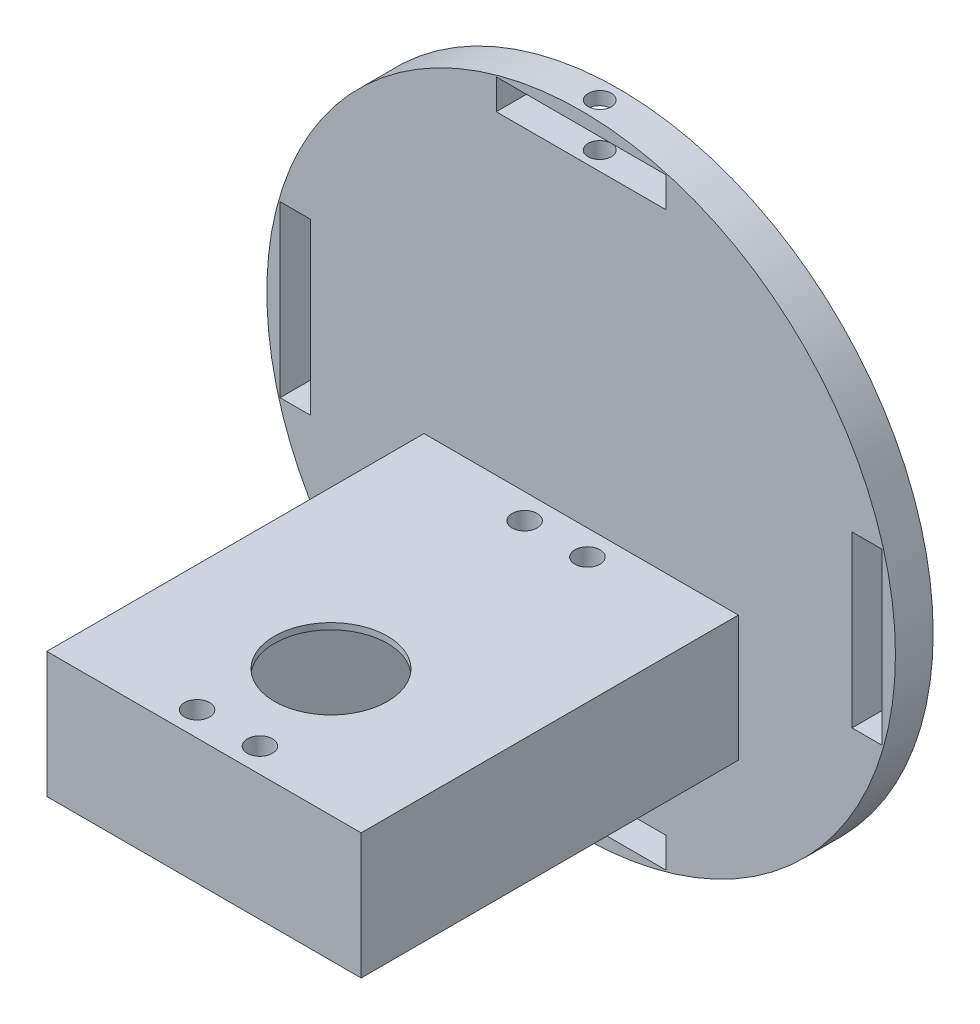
ISO-10303-21;
HEADER;
FILE_DESCRIPTION(('STEP AP214'),'2;1');
FILE_NAME('part.step','',(''),(''),'','','');
FILE_SCHEMA(('AUTOMOTIVE_DESIGN { 1 0 10303 214 1 1 1 1 }'));
ENDSEC;
DATA;
#1=APPLICATION_CONTEXT('core data for automotive mechanical design processes');
#2=APPLICATION_PROTOCOL_DEFINITION('international standard','automotive_design',2000,#1);
#3=PRODUCT_CONTEXT('',#1,'mechanical');
#4=PRODUCT('Part','Part','',(#3));
#5=PRODUCT_RELATED_PRODUCT_CATEGORY('part','',(#4));
#6=PRODUCT_DEFINITION_FORMATION('','',#4);
#7=PRODUCT_DEFINITION_CONTEXT('part definition',#1,'design');
#8=PRODUCT_DEFINITION('design','',#6,#7);
#9=PRODUCT_DEFINITION_SHAPE('','',#8);
#10=(LENGTH_UNIT() NAMED_UNIT(*) SI_UNIT(.MILLI.,.METRE.));
#11=(NAMED_UNIT(*) PLANE_ANGLE_UNIT() SI_UNIT($,.RADIAN.));
#12=(NAMED_UNIT(*) SI_UNIT($,.STERADIAN.) SOLID_ANGLE_UNIT());
#13=UNCERTAINTY_MEASURE_WITH_UNIT(LENGTH_MEASURE(1.E-05),#10,'distance_accuracy_value','');
#14=(GEOMETRIC_REPRESENTATION_CONTEXT(3) GLOBAL_UNCERTAINTY_ASSIGNED_CONTEXT((#13)) GLOBAL_UNIT_ASSIGNED_CONTEXT((#10,
#11,#12)) REPRESENTATION_CONTEXT('',''));
#15=CARTESIAN_POINT('',(0.,0.,0.));
#16=DIRECTION('',(0.,0.,1.));
#17=DIRECTION('',(1.,0.,0.));
#18=AXIS2_PLACEMENT_3D('',#15,#16,#17);
#19=CARTESIAN_POINT('',(11.,-18.5,59.));
#20=DIRECTION('',(0.,0.,1.));
#21=DIRECTION('',(1.,0.,0.));
#22=AXIS2_PLACEMENT_3D('',#19,#20,#21);
#23=PLANE('',#22);
#24=DIRECTION('',(-1.,0.,0.));
#25=VECTOR('',#24,1.);
#26=CARTESIAN_POINT('',(11.,-27.,59.));
#27=LINE('',#26,#25);
#28=CARTESIAN_POINT('',(11.,-27.,59.));
#29=VERTEX_POINT('',#28);
#30=CARTESIAN_POINT('',(-11.,-27.,59.));
#31=VERTEX_POINT('',#30);
#32=EDGE_CURVE('E359',#29,#31,#27,.T.);
#33=ORIENTED_EDGE('',*,*,#32,.T.);
#34=DIRECTION('',(0.,-1.,0.));
#35=VECTOR('',#34,1.);
#36=CARTESIAN_POINT('',(-11.,-18.5,59.));
#37=LINE('',#36,#35);
#38=CARTESIAN_POINT('',(-11.,-18.5,59.));
#39=VERTEX_POINT('',#38);
#40=EDGE_CURVE('E375',#39,#31,#37,.T.);
#41=ORIENTED_EDGE('',*,*,#40,.F.);
#42=DIRECTION('',(-1.,0.,0.));
#43=VECTOR('',#42,1.);
#44=CARTESIAN_POINT('',(11.,-18.5,59.));
#45=LINE('',#44,#43);
#46=CARTESIAN_POINT('',(11.,-18.5,59.));
#47=VERTEX_POINT('',#46);
#48=EDGE_CURVE('E10',#47,#39,#45,.T.);
#49=ORIENTED_EDGE('',*,*,#48,.F.);
#50=DIRECTION('',(0.,-1.,0.));
#51=VECTOR('',#50,1.);
#52=CARTESIAN_POINT('',(11.,-18.5,59.));
#53=LINE('',#52,#51);
#54=EDGE_CURVE('E378',#47,#29,#53,.T.);
#55=ORIENTED_EDGE('',*,*,#54,.T.);
#56=EDGE_LOOP('',(#33,#41,#49,#55));
#57=FACE_BOUND('',#56,.T.);
#58=ADVANCED_FACE('F16',(#57),#23,.F.);
#59=CARTESIAN_POINT('',(0.,-18.5,0.));
#60=DIRECTION('',(0.,-1.,0.));
#61=DIRECTION('',(0.,0.,-1.));
#62=AXIS2_PLACEMENT_3D('',#59,#60,#61);
#63=PLANE('',#62);
#64=CARTESIAN_POINT('',(-5.,-18.5,56.1));
#65=DIRECTION('',(0.,1.,0.));
#66=DIRECTION('',(0.,0.,-1.));
#67=AXIS2_PLACEMENT_3D('',#64,#65,#66);
#68=CIRCLE('',#67,2.);
#69=CARTESIAN_POINT('',(-5.,-18.5,54.1));
#70=VERTEX_POINT('',#69);
#71=EDGE_CURVE('E526',#70,#70,#68,.T.);
#72=ORIENTED_EDGE('',*,*,#71,.T.);
#73=EDGE_LOOP('',(#72));
#74=FACE_BOUND('',#73,.T.);
#75=DIRECTION('',(0.,0.,1.));
#76=VECTOR('',#75,1.);
#77=CARTESIAN_POINT('',(11.,-18.5,1.));
#78=LINE('',#77,#76);
#79=CARTESIAN_POINT('',(11.,-18.5,51.8));
#80=VERTEX_POINT('',#79);
#81=EDGE_CURVE('E382',#80,#47,#78,.T.);
#82=ORIENTED_EDGE('',*,*,#81,.T.);
#83=ORIENTED_EDGE('',*,*,#48,.T.);
#84=DIRECTION('',(0.,0.,-1.));
#85=VECTOR('',#84,1.);
#86=CARTESIAN_POINT('',(-11.,-18.5,59.));
#87=LINE('',#86,#85);
#88=CARTESIAN_POINT('',(-11.,-18.5,51.8));
#89=VERTEX_POINT('',#88);
#90=EDGE_CURVE('E379',#39,#89,#87,.T.);
#91=ORIENTED_EDGE('',*,*,#90,.T.);
#92=DIRECTION('',(-1.,0.,0.));
#93=VECTOR('',#92,1.);
#94=CARTESIAN_POINT('',(-11.,-18.5,51.8));
#95=LINE('',#94,#93);
#96=EDGE_CURVE('E340',#80,#89,#95,.T.);
#97=ORIENTED_EDGE('',*,*,#96,.F.);
#98=EDGE_LOOP('',(#82,#83,#91,#97));
#99=FACE_BOUND('',#98,.T.);
#100=CARTESIAN_POINT('',(5.,-18.5,56.1));
#101=DIRECTION('',(0.,-1.,0.));
#102=DIRECTION('',(0.,0.,-1.));
#103=AXIS2_PLACEMENT_3D('',#100,#101,#102);
#104=CIRCLE('',#103,2.);
#105=CARTESIAN_POINT('',(5.,-18.5,54.1));
#106=VERTEX_POINT('',#105);
#107=EDGE_CURVE('E424',#106,#106,#104,.T.);
#108=ORIENTED_EDGE('',*,*,#107,.F.);
#109=EDGE_LOOP('',(#108));
#110=FACE_BOUND('',#109,.T.);
#111=ADVANCED_FACE('F614',(#74,#99,#110),#63,.T.);
#112=CARTESIAN_POINT('',(-11.,-18.5,1.));
#113=DIRECTION('',(0.,0.,-1.));
#114=DIRECTION('',(0.,-1.,0.));
#115=AXIS2_PLACEMENT_3D('',#112,#113,#114);
#116=PLANE('',#115);
#117=DIRECTION('',(1.,0.,0.));
#118=VECTOR('',#117,1.);
#119=CARTESIAN_POINT('',(-11.,-27.,1.));
#120=LINE('',#119,#118);
#121=CARTESIAN_POINT('',(-11.,-27.,1.));
#122=VERTEX_POINT('',#121);
#123=CARTESIAN_POINT('',(11.,-27.,1.));
#124=VERTEX_POINT('',#123);
#125=EDGE_CURVE('E297',#122,#124,#120,.T.);
#126=ORIENTED_EDGE('',*,*,#125,.T.);
#127=DIRECTION('',(0.,-1.,0.));
#128=VECTOR('',#127,1.);
#129=CARTESIAN_POINT('',(11.,-18.5,1.));
#130=LINE('',#129,#128);
#131=CARTESIAN_POINT('',(11.,-18.5,1.));
#132=VERTEX_POINT('',#131);
#133=EDGE_CURVE('E262',#132,#124,#130,.T.);
#134=ORIENTED_EDGE('',*,*,#133,.F.);
#135=DIRECTION('',(1.,0.,0.));
#136=VECTOR('',#135,1.);
#137=CARTESIAN_POINT('',(-11.,-18.5,1.));
#138=LINE('',#137,#136);
#139=CARTESIAN_POINT('',(-11.,-18.5,1.));
#140=VERTEX_POINT('',#139);
#141=EDGE_CURVE('E29',#140,#132,#138,.T.);
#142=ORIENTED_EDGE('',*,*,#141,.F.);
#143=DIRECTION('',(0.,-1.,0.));
#144=VECTOR('',#143,1.);
#145=CARTESIAN_POINT('',(-11.,-18.5,1.));
#146=LINE('',#145,#144);
#147=EDGE_CURVE('E259',#140,#122,#146,.T.);
#148=ORIENTED_EDGE('',*,*,#147,.T.);
#149=EDGE_LOOP('',(#126,#134,#142,#148));
#150=FACE_BOUND('',#149,.T.);
#151=ADVANCED_FACE('F256',(#150),#116,.F.);
#152=CARTESIAN_POINT('',(0.,-18.5,0.));
#153=DIRECTION('',(0.,-1.,0.));
#154=DIRECTION('',(0.,0.,-1.));
#155=AXIS2_PLACEMENT_3D('',#152,#153,#154);
#156=PLANE('',#155);
#157=DIRECTION('',(0.,0.,-1.));
#158=VECTOR('',#157,1.);
#159=CARTESIAN_POINT('',(-11.,-18.5,59.));
#160=LINE('',#159,#158);
#161=CARTESIAN_POINT('',(-11.,-18.5,8.3));
#162=VERTEX_POINT('',#161);
#163=EDGE_CURVE('E268',#162,#140,#160,.T.);
#164=ORIENTED_EDGE('',*,*,#163,.T.);
#165=ORIENTED_EDGE('',*,*,#141,.T.);
#166=DIRECTION('',(0.,0.,1.));
#167=VECTOR('',#166,1.);
#168=CARTESIAN_POINT('',(11.,-18.5,1.));
#169=LINE('',#168,#167);
#170=CARTESIAN_POINT('',(11.,-18.5,8.3));
#171=VERTEX_POINT('',#170);
#172=EDGE_CURVE('E336',#132,#171,#169,.T.);
#173=ORIENTED_EDGE('',*,*,#172,.T.);
#174=DIRECTION('',(1.,0.,0.));
#175=VECTOR('',#174,1.);
#176=CARTESIAN_POINT('',(-11.,-18.5,8.3));
#177=LINE('',#176,#175);
#178=EDGE_CURVE('E272',#162,#171,#177,.T.);
#179=ORIENTED_EDGE('',*,*,#178,.F.);
#180=EDGE_LOOP('',(#164,#165,#173,#179));
#181=FACE_BOUND('',#180,.T.);
#182=CARTESIAN_POINT('',(5.,-18.5,4.));
#183=DIRECTION('',(0.,-1.,0.));
#184=DIRECTION('',(0.,0.,-1.));
#185=AXIS2_PLACEMENT_3D('',#182,#183,#184);
#186=CIRCLE('',#185,2.);
#187=CARTESIAN_POINT('',(5.,-18.5,2.));
#188=VERTEX_POINT('',#187);
#189=EDGE_CURVE('E425',#188,#188,#186,.T.);
#190=ORIENTED_EDGE('',*,*,#189,.F.);
#191=EDGE_LOOP('',(#190));
#192=FACE_BOUND('',#191,.T.);
#193=CARTESIAN_POINT('',(-5.,-18.5,4.));
#194=DIRECTION('',(0.,1.,0.));
#195=DIRECTION('',(0.,0.,-1.));
#196=AXIS2_PLACEMENT_3D('',#193,#194,#195);
#197=CIRCLE('',#196,2.);
#198=CARTESIAN_POINT('',(-5.,-18.5,2.));
#199=VERTEX_POINT('',#198);
#200=EDGE_CURVE('E360',#199,#199,#197,.T.);
#201=ORIENTED_EDGE('',*,*,#200,.T.);
#202=EDGE_LOOP('',(#201));
#203=FACE_BOUND('',#202,.T.);
#204=ADVANCED_FACE('F269',(#181,#192,#203),#156,.T.);
#205=CARTESIAN_POINT('',(0.,37.0906569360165,-2.95));
#206=DIRECTION('',(0.,1.,0.));
#207=DIRECTION('',(1.,0.,0.));
#208=AXIS2_PLACEMENT_3D('',#205,#206,#207);
#209=PLANE('',#208);
#210=CARTESIAN_POINT('',(0.,37.0906569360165,-2.95));
#211=DIRECTION('',(0.,1.,0.));
#212=DIRECTION('',(1.,0.,0.));
#213=AXIS2_PLACEMENT_3D('',#210,#211,#212);
#214=CIRCLE('',#213,1.85);
#215=CARTESIAN_POINT('',(1.85,37.0906569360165,-2.95));
#216=VERTEX_POINT('',#215);
#217=EDGE_CURVE('E41',#216,#216,#214,.T.);
#218=ORIENTED_EDGE('',*,*,#217,.T.);
#219=EDGE_LOOP('',(#218));
#220=FACE_BOUND('',#219,.T.);
#221=ADVANCED_FACE('F653',(#220),#209,.T.);
#222=CARTESIAN_POINT('',(0.,37.0906569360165,-2.95));
#223=DIRECTION('',(0.,1.,0.));
#224=DIRECTION('',(-1.,0.,0.));
#225=AXIS2_PLACEMENT_3D('',#222,#223,#224);
#226=CYLINDRICAL_SURFACE('',#225,1.85);
#227=ORIENTED_EDGE('',*,*,#217,.F.);
#228=EDGE_LOOP('',(#227));
#229=FACE_BOUND('',#228,.T.);
#230=CARTESIAN_POINT('',(0.,43.0906569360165,-2.95));
#231=DIRECTION('',(0.,1.,0.));
#232=DIRECTION('',(-1.,0.,0.));
#233=AXIS2_PLACEMENT_3D('',#230,#231,#232);
#234=CIRCLE('',#233,1.85);
#235=CARTESIAN_POINT('',(-1.85,43.0906569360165,-2.95));
#236=VERTEX_POINT('',#235);
#237=EDGE_CURVE('E319',#236,#236,#234,.T.);
#238=ORIENTED_EDGE('',*,*,#237,.T.);
#239=EDGE_LOOP('',(#238));
#240=FACE_BOUND('',#239,.T.);
#241=ADVANCED_FACE('F613',(#229,#240),#226,.F.);
#242=CARTESIAN_POINT('',(0.,55.4885006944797,-2.95));
#243=DIRECTION('',(0.,-1.,0.));
#244=DIRECTION('',(1.,0.,0.));
#245=AXIS2_PLACEMENT_3D('',#242,#243,#244);
#246=CYLINDRICAL_SURFACE('',#245,1.85);
#247=CARTESIAN_POINT('',(1.85000000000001,49.965763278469,-2.94999999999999));
#248=CARTESIAN_POINT('',(1.85000015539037,49.965763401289,-2.97089710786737));
#249=CARTESIAN_POINT('',(1.84964593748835,49.9657865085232,-2.99179425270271));
#250=CARTESIAN_POINT('',(1.8481874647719,49.9658750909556,-3.03481409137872));
#251=CARTESIAN_POINT('',(1.84703960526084,49.9659430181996,-3.05693530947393));
#252=CARTESIAN_POINT('',(1.84386307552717,49.96612111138,-3.10236947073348));
#253=CARTESIAN_POINT('',(1.84178833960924,49.9662334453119,-3.12567919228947));
#254=CARTESIAN_POINT('',(1.83662171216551,49.9665007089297,-3.17344616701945));
#255=CARTESIAN_POINT('',(1.83348139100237,49.9666575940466,-3.19789817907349));
#256=CARTESIAN_POINT('',(1.82604216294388,49.9670141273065,-3.24789383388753));
#257=CARTESIAN_POINT('',(1.82169256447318,49.9672155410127,-3.27342992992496));
#258=CARTESIAN_POINT('',(1.811689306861,49.9676613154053,-3.32552481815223));
#259=CARTESIAN_POINT('',(1.80598282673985,49.9679072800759,-3.35207346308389));
#260=CARTESIAN_POINT('',(1.79311740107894,49.9684423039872,-3.40611014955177));
#261=CARTESIAN_POINT('',(1.78590366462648,49.968732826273,-3.43358514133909));
#262=CARTESIAN_POINT('',(1.76987374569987,49.9693570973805,-3.48937554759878));
#263=CARTESIAN_POINT('',(1.76100099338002,49.9696921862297,-3.51767470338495));
#264=CARTESIAN_POINT('',(1.74150303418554,49.970405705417,-3.57499754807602));
#265=CARTESIAN_POINT('',(1.73081970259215,49.9707853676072,-3.60400146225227));
#266=CARTESIAN_POINT('',(1.70755238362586,49.9715881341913,-3.66259978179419));
#267=CARTESIAN_POINT('',(1.69490897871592,49.9720123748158,-3.69217058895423));
#268=CARTESIAN_POINT('',(1.66757697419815,49.9729043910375,-3.75174967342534));
#269=CARTESIAN_POINT('',(1.6528279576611,49.9733732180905,-3.78173023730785));
#270=CARTESIAN_POINT('',(1.62114681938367,49.9743544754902,-3.84195498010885));
#271=CARTESIAN_POINT('',(1.60415364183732,49.9748678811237,-3.87216701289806));
#272=CARTESIAN_POINT('',(1.5678526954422,49.9759384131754,-3.93266299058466));
#273=CARTESIAN_POINT('',(1.5484835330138,49.9764964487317,-3.96291019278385));
#274=CARTESIAN_POINT('',(1.51787322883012,49.9773587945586,-4.00778084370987));
#275=CARTESIAN_POINT('',(1.50726624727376,49.9776543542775,-4.02284098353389));
#276=CARTESIAN_POINT('',(1.4854231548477,49.9782565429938,-4.05289113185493));
#277=CARTESIAN_POINT('',(1.47417942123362,49.9785632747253,-4.0678756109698));
#278=CARTESIAN_POINT('',(1.4510507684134,49.9791877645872,-4.09774316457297));
#279=CARTESIAN_POINT('',(1.4391582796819,49.9795056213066,-4.11262037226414));
#280=CARTESIAN_POINT('',(1.41472066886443,49.9801524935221,-4.14224162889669));
#281=CARTESIAN_POINT('',(1.40216803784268,49.9804816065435,-4.15697948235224));
#282=CARTESIAN_POINT('',(1.3764000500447,49.9811505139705,-4.18628871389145));
#283=CARTESIAN_POINT('',(1.36317726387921,49.9814903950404,-4.20085355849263));
#284=CARTESIAN_POINT('',(1.33606018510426,49.9821826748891,-4.22978219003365));
#285=CARTESIAN_POINT('',(1.32215855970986,49.9825351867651,-4.24413910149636));
#286=CARTESIAN_POINT('',(1.29391573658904,49.9832397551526,-4.27237676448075));
#287=CARTESIAN_POINT('',(1.27957512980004,49.9835918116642,-4.28625810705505));
#288=CARTESIAN_POINT('',(1.25067978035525,49.9842832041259,-4.3133363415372));
#289=CARTESIAN_POINT('',(1.23613188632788,49.9846226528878,-4.32654053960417));
#290=CARTESIAN_POINT('',(1.20685709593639,49.985290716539,-4.35227304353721));
#291=CARTESIAN_POINT('',(1.19213670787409,49.9856194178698,-4.36480875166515));
#292=CARTESIAN_POINT('',(1.16255079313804,49.9862654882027,-4.38921417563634));
#293=CARTESIAN_POINT('',(1.14769143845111,49.986582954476,-4.40109137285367));
#294=CARTESIAN_POINT('',(1.117859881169,49.9872066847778,-4.42419106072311));
#295=CARTESIAN_POINT('',(1.10289352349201,49.9875130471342,-4.43542109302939));
#296=CARTESIAN_POINT('',(1.07287979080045,49.9881145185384,-4.45723835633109));
#297=CARTESIAN_POINT('',(1.05783792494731,49.9884097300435,-4.46783318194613));
#298=CARTESIAN_POINT('',(1.01302122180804,49.9892710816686,-4.49840993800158));
#299=CARTESIAN_POINT('',(0.982810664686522,49.9898284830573,-4.51775917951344));
#300=CARTESIAN_POINT('',(0.92238751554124,49.9908978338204,-4.55402603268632));
#301=CARTESIAN_POINT('',(0.892211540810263,49.9914106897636,-4.57100481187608));
#302=CARTESIAN_POINT('',(0.832057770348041,49.9923909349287,-4.60266238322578));
#303=CARTESIAN_POINT('',(0.802112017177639,49.9928592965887,-4.61740200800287));
#304=CARTESIAN_POINT('',(0.742600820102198,49.993750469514,-4.64471991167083));
#305=CARTESIAN_POINT('',(0.713063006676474,49.9941743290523,-4.65735838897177));
#306=CARTESIAN_POINT('',(0.65452845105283,49.9949764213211,-4.68061996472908));
#307=CARTESIAN_POINT('',(0.625555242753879,49.9953557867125,-4.69130226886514));
#308=CARTESIAN_POINT('',(0.568291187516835,49.9960688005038,-4.71080170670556));
#309=CARTESIAN_POINT('',(0.540020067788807,49.9964036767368,-4.71967676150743));
#310=CARTESIAN_POINT('',(0.484282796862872,49.99702761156,-4.73571424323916));
#311=CARTESIAN_POINT('',(0.456832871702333,49.9973180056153,-4.742933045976));
#312=CARTESIAN_POINT('',(0.402843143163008,49.9978528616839,-4.75581099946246));
#313=CARTESIAN_POINT('',(0.376316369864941,49.9980987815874,-4.76152475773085));
#314=CARTESIAN_POINT('',(0.324261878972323,49.9985445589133,-4.77154442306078));
#315=CARTESIAN_POINT('',(0.298744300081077,49.9987460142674,-4.77590297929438));
#316=CARTESIAN_POINT('',(0.248782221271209,49.9991027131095,-4.78336146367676));
#317=CARTESIAN_POINT('',(0.224345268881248,49.9992597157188,-4.7865119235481));
#318=CARTESIAN_POINT('',(0.17660489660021,49.9995273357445,-4.79169966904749));
#319=CARTESIAN_POINT('',(0.15330672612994,49.9996398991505,-4.79378523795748));
#320=CARTESIAN_POINT('',(0.10789212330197,49.9998184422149,-4.79698388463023));
#321=CARTESIAN_POINT('',(0.0857789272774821,49.9998865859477,-4.79814289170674));
#322=CARTESIAN_POINT('',(0.0427716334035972,49.9999760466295,-4.79962350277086));
#323=CARTESIAN_POINT('',(0.0218790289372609,49.99999978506,-4.79998859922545));
#324=CARTESIAN_POINT('',(-0.0199293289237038,50.0000001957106,-4.80001088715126));
#325=CARTESIAN_POINT('',(-0.0408450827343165,49.9999768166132,-4.79966730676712));
#326=CARTESIAN_POINT('',(-0.0838997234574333,49.9998880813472,-4.79822943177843));
#327=CARTESIAN_POINT('',(-0.106037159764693,49.9998203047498,-4.79709158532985));
#328=CARTESIAN_POINT('',(-0.151501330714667,49.9996424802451,-4.79393476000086));
#329=CARTESIAN_POINT('',(-0.174824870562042,49.9995302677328,-4.79186978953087));
#330=CARTESIAN_POINT('',(-0.222617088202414,49.9992633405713,-4.78672252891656));
#331=CARTESIAN_POINT('',(-0.247080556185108,49.9991066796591,-4.78359189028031));
#332=CARTESIAN_POINT('',(-0.297096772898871,49.9987506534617,-4.77617211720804));
#333=CARTESIAN_POINT('',(-0.322642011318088,49.9985495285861,-4.77183238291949));
#334=CARTESIAN_POINT('',(-0.374752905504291,49.998104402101,-4.76184920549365));
#335=CARTESIAN_POINT('',(-0.401308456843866,49.9978588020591,-4.75615304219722));
#336=CARTESIAN_POINT('',(-0.455356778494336,49.9973245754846,-4.74330889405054));
#337=CARTESIAN_POINT('',(-0.482836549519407,49.997034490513,-4.73610622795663));
#338=CARTESIAN_POINT('',(-0.538634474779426,49.9964111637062,-4.72009940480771));
#339=CARTESIAN_POINT('',(-0.566936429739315,49.9960765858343,-4.71123879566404));
#340=CARTESIAN_POINT('',(-0.624263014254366,49.9953641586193,-4.69176640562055));
#341=CARTESIAN_POINT('',(-0.653267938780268,49.9949850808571,-4.68109662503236));
#342=CARTESIAN_POINT('',(-0.711866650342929,49.9941835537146,-4.65785802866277));
#343=CARTESIAN_POINT('',(-0.741436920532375,49.9937599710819,-4.64522992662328));
#344=CARTESIAN_POINT('',(-0.801013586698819,49.9928693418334,-4.6179304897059));
#345=CARTESIAN_POINT('',(-0.830992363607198,49.9924012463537,-4.60319887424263));
#346=CARTESIAN_POINT('',(-0.891212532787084,49.9914215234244,-4.57155483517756));
#347=CARTESIAN_POINT('',(-0.921421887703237,49.9909089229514,-4.55458149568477));
#348=CARTESIAN_POINT('',(-0.98191191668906,49.9898400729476,-4.51832284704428));
#349=CARTESIAN_POINT('',(-1.01215597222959,49.9892829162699,-4.49897628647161));
#350=CARTESIAN_POINT('',(-1.05702254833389,49.9884219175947,-4.46840128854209));
#351=CARTESIAN_POINT('',(-1.07208109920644,49.9881268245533,-4.45780672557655));
#352=CARTESIAN_POINT('',(-1.10212812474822,49.9875255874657,-4.4359892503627));
#353=CARTESIAN_POINT('',(-1.11711108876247,49.9872193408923,-4.42475873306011));
#354=CARTESIAN_POINT('',(-1.14697573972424,49.9865958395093,-4.40165732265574));
#355=CARTESIAN_POINT('',(-1.16185157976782,49.9862784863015,-4.38977887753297));
#356=CARTESIAN_POINT('',(-1.19147030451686,49.9856326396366,-4.36537019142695));
#357=CARTESIAN_POINT('',(-1.20620701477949,49.9853040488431,-4.35283245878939));
#358=CARTESIAN_POINT('',(-1.23551424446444,49.9846362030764,-4.32709512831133));
#359=CARTESIAN_POINT('',(-1.25007825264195,49.9842968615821,-4.31388811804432));
#360=CARTESIAN_POINT('',(-1.27900557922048,49.9836056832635,-4.28680347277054));
#361=CARTESIAN_POINT('',(-1.29336204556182,49.9832537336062,-4.27291852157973));
#362=CARTESIAN_POINT('',(-1.32163466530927,49.9825494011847,-4.24467430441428));
#363=CARTESIAN_POINT('',(-1.33555027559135,49.9821970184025,-4.23031449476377));
#364=CARTESIAN_POINT('',(-1.36269437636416,49.9815049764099,-4.20137977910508));
#365=CARTESIAN_POINT('',(-1.37593021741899,49.9811652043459,-4.18681177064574));
#366=CARTESIAN_POINT('',(-1.40172339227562,49.9804964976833,-4.15749600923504));
#367=CARTESIAN_POINT('',(-1.4142881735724,49.9801674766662,-4.14275481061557));
#368=CARTESIAN_POINT('',(-1.43874919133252,49.9795207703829,-4.11312674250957));
#369=CARTESIAN_POINT('',(-1.45065295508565,49.9792029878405,-4.09824608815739));
#370=CARTESIAN_POINT('',(-1.47380329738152,49.9785786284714,-4.06837159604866));
#371=CARTESIAN_POINT('',(-1.48505746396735,49.9782719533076,-4.05338364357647));
#372=CARTESIAN_POINT('',(-1.50692059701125,49.9776698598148,-4.02332657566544));
#373=CARTESIAN_POINT('',(-1.5175372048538,49.9773743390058,-4.00826300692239));
#374=CARTESIAN_POINT('',(-1.5481745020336,49.9765120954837,-3.96338298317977));
#375=CARTESIAN_POINT('',(-1.56756067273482,49.9759540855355,-3.93312929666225));
#376=CARTESIAN_POINT('',(-1.60389274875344,49.9748835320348,-3.87262114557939));
#377=CARTESIAN_POINT('',(-1.62090019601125,49.9743700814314,-3.8424035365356));
#378=CARTESIAN_POINT('',(-1.65260735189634,49.9733886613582,-3.78216884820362));
#379=CARTESIAN_POINT('',(-1.6673682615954,49.9729197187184,-3.75218401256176));
#380=CARTESIAN_POINT('',(-1.69472190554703,49.9720273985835,-3.69259793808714));
#381=CARTESIAN_POINT('',(-1.70737519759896,49.9716029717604,-3.66302449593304));
#382=CARTESIAN_POINT('',(-1.73066052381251,49.9707997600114,-3.60442274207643));
#383=CARTESIAN_POINT('',(-1.7413521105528,49.9704198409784,-3.57541809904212));
#384=CARTESIAN_POINT('',(-1.76086518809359,49.9697057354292,-3.51809585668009));
#385=CARTESIAN_POINT('',(-1.76974493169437,49.969370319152,-3.48979809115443));
#386=CARTESIAN_POINT('',(-1.7857878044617,49.9687453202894,-3.43401269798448));
#387=CARTESIAN_POINT('',(-1.79300762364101,49.968454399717,-3.40654137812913));
#388=CARTESIAN_POINT('',(-1.80588453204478,49.9679185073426,-3.35251439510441));
#389=CARTESIAN_POINT('',(-1.81159652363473,49.9676720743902,-3.32597182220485));
#390=CARTESIAN_POINT('',(-1.82161044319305,49.967225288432,-3.27389152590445));
#391=CARTESIAN_POINT('',(-1.82596529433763,49.967023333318,-3.2483639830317));
#392=CARTESIAN_POINT('',(-1.83341496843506,49.9666656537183,-3.19838793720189));
#393=CARTESIAN_POINT('',(-1.83656057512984,49.966508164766,-3.17394700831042));
#394=CARTESIAN_POINT('',(-1.84173796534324,49.9662395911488,-3.126204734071));
#395=CARTESIAN_POINT('',(-1.84381826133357,49.9661265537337,-3.10290865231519));
#396=CARTESIAN_POINT('',(-1.84700639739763,49.9659470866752,-3.05750430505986));
#397=CARTESIAN_POINT('',(-1.84816037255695,49.965878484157,-3.03539928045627));
#398=CARTESIAN_POINT('',(-1.84963156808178,49.9657881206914,-2.99241438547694));
#399=CARTESIAN_POINT('',(-1.8499924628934,49.9657639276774,-2.97153600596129));
#400=CARTESIAN_POINT('',(-1.85000731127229,49.965762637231,-2.92975692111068));
#401=CARTESIAN_POINT('',(-1.8496605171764,49.9657855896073,-2.90885621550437));
#402=CARTESIAN_POINT('',(-1.84821708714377,49.9658735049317,-2.86583306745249));
#403=CARTESIAN_POINT('',(-1.84707697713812,49.965940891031,-2.84371207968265));
#404=CARTESIAN_POINT('',(-1.84391673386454,49.9661179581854,-2.79828214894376));
#405=CARTESIAN_POINT('',(-1.84185069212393,49.9662298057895,-2.77497640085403));
#406=CARTESIAN_POINT('',(-1.83670264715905,49.9664960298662,-2.72722103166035));
#407=CARTESIAN_POINT('',(-1.83357238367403,49.9666523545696,-2.70277661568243));
#408=CARTESIAN_POINT('',(-1.82615497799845,49.9670077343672,-2.65279966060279));
#409=CARTESIAN_POINT('',(-1.82181732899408,49.9672085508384,-2.62727462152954));
#410=CARTESIAN_POINT('',(-1.81184020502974,49.9676530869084,-2.57520514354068));
#411=CARTESIAN_POINT('',(-1.80614810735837,49.9678984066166,-2.54867079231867));
#412=CARTESIAN_POINT('',(-1.79331424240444,49.9684320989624,-2.49466571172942));
#413=CARTESIAN_POINT('',(-1.78611789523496,49.9687219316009,-2.46720795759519));
#414=CARTESIAN_POINT('',(-1.77012612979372,49.9693447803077,-2.41145469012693));
#415=CARTESIAN_POINT('',(-1.76127436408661,49.9696791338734,-2.38317534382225));
#416=CARTESIAN_POINT('',(-1.74182234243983,49.9703911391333,-2.3258943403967));
#417=CARTESIAN_POINT('',(-1.73116419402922,49.9707700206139,-2.29691234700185));
#418=CARTESIAN_POINT('',(-1.70795179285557,49.9715711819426,-2.23835955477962));
#419=CARTESIAN_POINT('',(-1.69533836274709,49.9719945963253,-2.2088122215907));
#420=CARTESIAN_POINT('',(-1.66807143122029,49.9728849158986,-2.14928113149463));
#421=CARTESIAN_POINT('',(-1.65335775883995,49.9733528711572,-2.11932493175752));
#422=CARTESIAN_POINT('',(-1.62175296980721,49.9743323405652,-2.05914921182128));
#423=CARTESIAN_POINT('',(-1.60480104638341,49.9748448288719,-2.0289616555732));
#424=CARTESIAN_POINT('',(-1.56858876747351,49.9759134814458,-1.96851406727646));
#425=CARTESIAN_POINT('',(-1.54926726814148,49.9764705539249,-1.93829056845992));
#426=CARTESIAN_POINT('',(-1.51873220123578,49.9773314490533,-1.89345323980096));
#427=CARTESIAN_POINT('',(-1.50815155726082,49.9776265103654,-1.87840432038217));
#428=CARTESIAN_POINT('',(-1.48636285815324,49.9782276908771,-1.84837606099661));
#429=CARTESIAN_POINT('',(-1.47514721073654,49.9785339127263,-1.8334022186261));
#430=CARTESIAN_POINT('',(-1.45207648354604,49.9791573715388,-1.80355524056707));
#431=CARTESIAN_POINT('',(-1.44021386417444,49.9794747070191,-1.78868793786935));
#432=CARTESIAN_POINT('',(-1.41583777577,49.9801205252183,-1.75908564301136));
#433=CARTESIAN_POINT('',(-1.40331682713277,49.9804491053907,-1.74435681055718));
#434=CARTESIAN_POINT('',(-1.37761400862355,49.9811169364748,-1.71506461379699));
#435=CARTESIAN_POINT('',(-1.36442473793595,49.9814562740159,-1.70050774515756));
#436=CARTESIAN_POINT('',(-1.33737650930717,49.9821474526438,-1.67159389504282));
#437=CARTESIAN_POINT('',(-1.32351024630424,49.9824994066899,-1.65724374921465));
#438=CARTESIAN_POINT('',(-1.29529829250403,49.9832038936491,-1.62897702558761));
#439=CARTESIAN_POINT('',(-1.2809518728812,49.9835564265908,-1.61506117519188));
#440=CARTESIAN_POINT('',(-1.25204375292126,49.9842487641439,-1.58791578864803));
#441=CARTESIAN_POINT('',(-1.23748894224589,49.9845886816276,-1.57467891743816));
#442=CARTESIAN_POINT('',(-1.20819934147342,49.9852576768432,-1.54888291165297));
#443=CARTESIAN_POINT('',(-1.19347109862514,49.985586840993,-1.53631634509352));
#444=CARTESIAN_POINT('',(-1.16386866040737,49.9862338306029,-1.51185102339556));
#445=CARTESIAN_POINT('',(-1.14900067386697,49.9865517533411,-1.49994475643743));
#446=CARTESIAN_POINT('',(-1.11915119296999,49.987176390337,-1.47678871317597));
#447=CARTESIAN_POINT('',(-1.10417557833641,49.9874832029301,-1.46553136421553));
#448=CARTESIAN_POINT('',(-1.07414282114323,49.9880855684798,-1.44366121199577));
#449=CARTESIAN_POINT('',(-1.05909122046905,49.9883812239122,-1.43304078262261));
#450=CARTESIAN_POINT('',(-1.01424589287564,49.9892438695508,-1.40239099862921));
#451=CARTESIAN_POINT('',(-0.984014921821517,49.9898021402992,-1.38299543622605));
#452=CARTESIAN_POINT('',(-0.923550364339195,49.9908732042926,-1.34664240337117));
#453=CARTESIAN_POINT('',(-0.893353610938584,49.9913869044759,-1.32962350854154));
#454=CARTESIAN_POINT('',(-0.833158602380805,49.9923688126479,-1.29789163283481));
#455=CARTESIAN_POINT('',(-0.803192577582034,49.9928379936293,-1.28311756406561));
#456=CARTESIAN_POINT('',(-0.743641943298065,49.9937307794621,-1.25573612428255));
#457=CARTESIAN_POINT('',(-0.714085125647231,49.9941554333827,-1.24306830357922));
#458=CARTESIAN_POINT('',(-0.655514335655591,49.9949590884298,-1.21975278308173));
#459=CARTESIAN_POINT('',(-0.626524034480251,49.995339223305,-1.20904563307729));
#460=CARTESIAN_POINT('',(-0.569228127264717,49.9960537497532,-1.18950062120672));
#461=CARTESIAN_POINT('',(-0.540942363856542,49.9963893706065,-1.18060460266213));
#462=CARTESIAN_POINT('',(-0.485178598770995,49.997014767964,-1.1645286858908));
#463=CARTESIAN_POINT('',(-0.457716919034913,49.9973058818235,-1.15729218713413));
#464=CARTESIAN_POINT('',(-0.40370684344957,49.9978421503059,-1.14438172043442));
#465=CARTESIAN_POINT('',(-0.377171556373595,49.9980887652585,-1.13865293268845));
#466=CARTESIAN_POINT('',(-0.325103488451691,49.9985359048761,-1.12860549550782));
#467=CARTESIAN_POINT('',(-0.299580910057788,49.9987380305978,-1.12423399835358));
#468=CARTESIAN_POINT('',(-0.249612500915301,49.9990960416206,-1.11675135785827));
#469=CARTESIAN_POINT('',(-0.225174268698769,49.999253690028,-1.11358949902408));
#470=CARTESIAN_POINT('',(-0.177435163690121,49.9995225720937,-1.10838015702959));
#471=CARTESIAN_POINT('',(-0.154139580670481,49.999635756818,-1.10628422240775));
#472=CARTESIAN_POINT('',(-0.108734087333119,49.9998155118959,-1.1030655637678));
#473=CARTESIAN_POINT('',(-0.0866274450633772,49.9998842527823,-1.10189675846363));
#474=CARTESIAN_POINT('',(-0.0436372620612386,49.9999748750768,-1.10039683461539));
#475=CARTESIAN_POINT('',(-0.0227552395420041,49.9999991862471,-1.10002208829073));
#476=CARTESIAN_POINT('',(0.0190508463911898,50.0000007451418,-1.09997976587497));
#477=CARTESIAN_POINT('',(0.0399749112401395,49.9999778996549,-1.1003135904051));
#478=CARTESIAN_POINT('',(0.0830463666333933,49.9998901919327,-1.10173193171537));
#479=CARTESIAN_POINT('',(0.105192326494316,49.999822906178,-1.10286001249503));
#480=CARTESIAN_POINT('',(0.150673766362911,49.9996460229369,-1.10599733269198));
#481=CARTESIAN_POINT('',(0.174006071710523,49.9995342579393,-1.10805257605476));
#482=CARTESIAN_POINT('',(0.221816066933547,49.9992681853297,-1.11318045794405));
#483=CARTESIAN_POINT('',(0.246288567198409,49.999111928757,-1.1163014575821));
#484=CARTESIAN_POINT('',(0.296323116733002,49.9987566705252,-1.12370207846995));
#485=CARTESIAN_POINT('',(0.321877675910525,49.9985559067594,-1.12803231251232));
#486=CARTESIAN_POINT('',(0.374007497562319,49.9981114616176,-1.13799666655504));
#487=CARTESIAN_POINT('',(0.400572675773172,49.9978661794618,-1.14368352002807));
#488=CARTESIAN_POINT('',(0.454640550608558,49.9973325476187,-1.15650927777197));
#489=CARTESIAN_POINT('',(0.482130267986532,49.9970427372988,-1.16370287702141));
#490=CARTESIAN_POINT('',(0.537948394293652,49.9964199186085,-1.17969184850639));
#491=CARTESIAN_POINT('',(0.56626062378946,49.9960855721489,-1.18854368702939));
#492=CARTESIAN_POINT('',(0.623608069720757,49.9953735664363,-1.20799887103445));
#493=CARTESIAN_POINT('',(0.652623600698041,49.9949946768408,-1.21866023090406));
#494=CARTESIAN_POINT('',(0.711243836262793,49.9941934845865,-1.24188237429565));
#495=CARTESIAN_POINT('',(0.74082504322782,49.9937700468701,-1.25450245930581));
#496=CARTESIAN_POINT('',(0.800423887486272,49.9928796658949,-1.28178630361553));
#497=CARTESIAN_POINT('',(0.830413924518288,49.9924116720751,-1.29651035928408));
#498=CARTESIAN_POINT('',(0.890656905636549,49.9914321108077,-1.32813977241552));
#499=CARTESIAN_POINT('',(0.920877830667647,49.9909195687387,-1.34510606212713));
#500=CARTESIAN_POINT('',(0.981391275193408,49.9898507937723,-1.38135115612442));
#501=CARTESIAN_POINT('',(1.01164719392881,49.9892936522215,-1.40069122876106));
#502=CARTESIAN_POINT('',(1.05653170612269,49.9884326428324,-1.43125709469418));
#503=CARTESIAN_POINT('',(1.07159628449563,49.9881375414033,-1.44184863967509));
#504=CARTESIAN_POINT('',(1.10165542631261,49.9875362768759,-1.4636602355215));
#505=CARTESIAN_POINT('',(1.11664448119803,49.9872300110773,-1.47488789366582));
#506=CARTESIAN_POINT('',(1.14652137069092,49.9866064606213,-1.49798374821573));
#507=CARTESIAN_POINT('',(1.16140336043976,49.9862890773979,-1.50985949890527));
#508=CARTESIAN_POINT('',(1.19103443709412,49.9856431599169,-1.53426296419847));
#509=CARTESIAN_POINT('',(1.20577735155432,49.9853145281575,-1.54679817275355));
#510=CARTESIAN_POINT('',(1.23509703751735,49.9846465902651,-1.57253062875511));
#511=CARTESIAN_POINT('',(1.24966729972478,49.9843071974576,-1.58573529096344));
#512=CARTESIAN_POINT('',(1.27860717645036,49.9836159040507,-1.61281541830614));
#513=CARTESIAN_POINT('',(1.29296994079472,49.9832638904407,-1.6266982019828));
#514=CARTESIAN_POINT('',(1.32126843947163,49.9825590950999,-1.65495161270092));
#515=CARTESIAN_POINT('',(1.33520320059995,49.9822063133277,-1.66932321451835));
#516=CARTESIAN_POINT('',(1.36238421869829,49.9815134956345,-1.69828222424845));
#517=CARTESIAN_POINT('',(1.3756378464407,49.9811733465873,-1.71286271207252));
#518=CARTESIAN_POINT('',(1.4014652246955,49.9805039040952,-1.74220403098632));
#519=CARTESIAN_POINT('',(1.41404644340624,49.9801745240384,-1.75695828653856));
#520=CARTESIAN_POINT('',(1.43853898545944,49.9795271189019,-1.78661296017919));
#521=CARTESIAN_POINT('',(1.45045785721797,49.9792089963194,-1.80150714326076));
#522=CARTESIAN_POINT('',(1.47363709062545,49.9785839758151,-1.83140908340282));
#523=CARTESIAN_POINT('',(1.48490506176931,49.978276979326,-1.84641093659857));
#524=CARTESIAN_POINT('',(1.50679450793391,49.9776742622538,-1.87649609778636));
#525=CARTESIAN_POINT('',(1.5174236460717,49.977378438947,-1.89157384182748));
#526=CARTESIAN_POINT('',(1.54809609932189,49.9765153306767,-1.93649598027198));
#527=CARTESIAN_POINT('',(1.56750368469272,49.9759567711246,-1.96677853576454));
#528=CARTESIAN_POINT('',(1.60387377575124,49.9748851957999,-2.02734461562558));
#529=CARTESIAN_POINT('',(1.62089799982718,49.9743712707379,-2.05759117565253));
#530=CARTESIAN_POINT('',(1.65263427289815,49.9733889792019,-2.11788337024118));
#531=CARTESIAN_POINT('',(1.66740769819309,49.9729196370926,-2.14789667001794));
#532=CARTESIAN_POINT('',(1.69478234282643,49.9720265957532,-2.20753876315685));
#533=CARTESIAN_POINT('',(1.70744429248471,49.9716018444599,-2.23713968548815));
#534=CARTESIAN_POINT('',(1.73074333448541,49.9707980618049,-2.29579505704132));
#535=CARTESIAN_POINT('',(1.74144014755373,49.9704178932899,-2.32482577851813));
#536=CARTESIAN_POINT('',(1.76096052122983,49.9697033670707,-2.3821984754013));
#537=CARTESIAN_POINT('',(1.76984249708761,49.9693677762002,-2.41052057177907));
#538=CARTESIAN_POINT('',(1.78588712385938,49.9687425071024,-2.4663526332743));
#539=CARTESIAN_POINT('',(1.7931066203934,49.9684514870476,-2.49384625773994));
#540=CARTESIAN_POINT('',(1.80598061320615,49.9679154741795,-2.5479156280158));
#541=CARTESIAN_POINT('',(1.81169015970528,49.9676690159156,-2.57447826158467));
#542=CARTESIAN_POINT('',(1.82169734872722,49.9672222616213,-2.62659628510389));
#543=CARTESIAN_POINT('',(1.82604805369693,49.967020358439,-2.65214148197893));
#544=CARTESIAN_POINT('',(1.83348800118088,49.9666628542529,-2.70215031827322));
#545=CARTESIAN_POINT('',(1.83662815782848,49.9665054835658,-2.72660637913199));
#546=CARTESIAN_POINT('',(1.84179361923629,49.9662372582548,-2.77437632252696));
#547=CARTESIAN_POINT('',(1.84386755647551,49.9661244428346,-2.79768494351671));
#548=CARTESIAN_POINT('',(1.84704225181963,49.965945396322,-2.84311172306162));
#549=CARTESIAN_POINT('',(1.84818925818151,49.9658769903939,-2.86522664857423));
#550=CARTESIAN_POINT('',(1.84964632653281,49.9657874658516,-2.90822871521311));
#551=CARTESIAN_POINT('',(1.85000015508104,49.9657638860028,-2.92911437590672));
#552=CARTESIAN_POINT('',(1.85000000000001,49.965763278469,-2.95));
#553=B_SPLINE_CURVE_WITH_KNOTS('',3,(#247,#248,#249,#250,#251,#252,#253,#254,#255,#256,#257,
#258,#259,#260,#261,#262,#263,#264,#265,#266,#267,#268,#269,#270,#271,#272,#273,#274,#275,#276,
#277,#278,#279,#280,#281,#282,#283,#284,#285,#286,#287,#288,#289,#290,#291,#292,#293,#294,#295,
#296,#297,#298,#299,#300,#301,#302,#303,#304,#305,#306,#307,#308,#309,#310,#311,#312,#313,#314,
#315,#316,#317,#318,#319,#320,#321,#322,#323,#324,#325,#326,#327,#328,#329,#330,#331,#332,#333,
#334,#335,#336,#337,#338,#339,#340,#341,#342,#343,#344,#345,#346,#347,#348,#349,#350,#351,#352,
#353,#354,#355,#356,#357,#358,#359,#360,#361,#362,#363,#364,#365,#366,#367,#368,#369,#370,#371,
#372,#373,#374,#375,#376,#377,#378,#379,#380,#381,#382,#383,#384,#385,#386,#387,#388,#389,#390,
#391,#392,#393,#394,#395,#396,#397,#398,#399,#400,#401,#402,#403,#404,#405,#406,#407,#408,#409,
#410,#411,#412,#413,#414,#415,#416,#417,#418,#419,#420,#421,#422,#423,#424,#425,#426,#427,#428,
#429,#430,#431,#432,#433,#434,#435,#436,#437,#438,#439,#440,#441,#442,#443,#444,#445,#446,#447,
#448,#449,#450,#451,#452,#453,#454,#455,#456,#457,#458,#459,#460,#461,#462,#463,#464,#465,#466,
#467,#468,#469,#470,#471,#472,#473,#474,#475,#476,#477,#478,#479,#480,#481,#482,#483,#484,#485,
#486,#487,#488,#489,#490,#491,#492,#493,#494,#495,#496,#497,#498,#499,#500,#501,#502,#503,#504,
#505,#506,#507,#508,#509,#510,#511,#512,#513,#514,#515,#516,#517,#518,#519,#520,#521,#522,#523,
#524,#525,#526,#527,#528,#529,#530,#531,#532,#533,#534,#535,#536,#537,#538,#539,#540,#541,#542,
#543,#544,#545,#546,#547,#548,#549,#550,#551,#552),.UNSPECIFIED.,.F.,.F.,(4,2,2,2,2,2,2,2,2,2,2,
2,2,2,2,2,2,2,2,2,2,2,2,2,2,2,2,2,2,2,2,2,2,2,2,2,2,2,2,2,2,2,2,2,2,2,2,2,2,2,2,2,2,2,2,2,2,2,2,
2,2,2,2,2,2,2,2,2,2,2,2,2,2,2,2,2,2,2,2,2,2,2,2,2,2,2,2,2,2,2,2,2,2,2,2,2,2,2,2,2,2,2,2,2,2,2,2,
2,2,2,2,2,2,2,2,2,2,2,2,2,2,2,2,2,2,2,2,2,2,2,2,2,2,2,2,2,2,2,2,2,2,2,2,2,2,2,2,2,2,2,2,2,4),
(0.,0.0626884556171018,0.129127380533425,0.199316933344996,0.273257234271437,0.350948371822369,
0.43239040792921,0.517583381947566,0.606527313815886,0.699222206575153,0.795668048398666,
0.895864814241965,0.999812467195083,1.10751095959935,1.16277291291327,1.21897287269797,
1.27611084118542,1.33418682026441,1.39320081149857,1.45315281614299,1.51302738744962,
1.57196627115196,1.62996946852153,1.6870369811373,1.74316881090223,1.79836496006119,
1.9059388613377,2.00977122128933,2.10986199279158,2.20621113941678,2.29881863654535,
2.38768447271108,2.47280865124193,2.55419119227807,2.63183213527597,2.70573154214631,
2.7758895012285,2.8423061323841,2.90498159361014,2.96772535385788,3.03421127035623,
3.10443950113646,3.17841016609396,3.25612335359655,3.33757912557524,3.42277752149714,
3.51171856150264,3.60440224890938,3.7008285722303,3.80099750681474,3.90490901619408,
4.01256305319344,4.06779965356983,4.12397218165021,4.18108063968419,4.2391250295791,
4.29810535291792,4.35802161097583,4.41800902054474,4.47705634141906,4.53516357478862,
4.59233072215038,4.6485577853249,4.70384476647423,4.81158707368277,4.91557024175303,
5.01579422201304,5.11225897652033,5.20496447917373,5.29391071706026,5.37909769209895,
5.46052542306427,5.53819394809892,5.61210332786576,5.68225364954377,5.74864503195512,
5.81127763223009,5.87397643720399,5.94041345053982,6.0105888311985,6.0845026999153,
6.16215514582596,6.24354623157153,6.32867599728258,6.41754446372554,6.51015163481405,
6.60649749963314,6.70658203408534,6.81040520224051,6.91796695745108,6.97315592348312,
7.02927983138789,7.08633868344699,7.14433248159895,7.20326122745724,7.26312492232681,
7.3230840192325,7.38210414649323,7.44018530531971,7.49732749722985,7.55353072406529,
7.60879498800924,7.71649523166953,7.82044081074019,7.92063167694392,8.01706779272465,
8.10974913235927,8.19867568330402,8.28384744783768,8.36526444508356,8.44292671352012,
8.51683431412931,8.58698733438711,8.65338589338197,8.71603014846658,8.77879834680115,
8.84530828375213,8.91556011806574,8.98955397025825,9.06728992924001,9.1487680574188,
9.23398839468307,9.3229509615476,9.41565576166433,9.51210278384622,9.61229200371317,
9.71622338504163,9.82389688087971,9.87914305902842,9.93532506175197,9.99244289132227,
10.050496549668,10.1094860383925,10.1694113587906,10.2294641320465,10.2885750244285,
10.3467440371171,10.4039711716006,10.460256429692,10.5155998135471,10.6234495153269,
10.7275329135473,10.8278499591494,10.9244006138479,11.0171848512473,11.106202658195,
11.1914540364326,11.2729390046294,11.3506576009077,11.424609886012,11.4947959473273,
11.5612159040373,11.6238699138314),.UNSPECIFIED.);
#554=CARTESIAN_POINT('',(1.85,49.965763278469,-2.95));
#555=VERTEX_POINT('',#554);
#556=EDGE_CURVE('E350',#555,#555,#553,.T.);
#557=ORIENTED_EDGE('',*,*,#556,.T.);
#558=EDGE_LOOP('',(#557));
#559=FACE_BOUND('',#558,.T.);
#560=CARTESIAN_POINT('',(0.,47.8906569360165,-2.95));
#561=DIRECTION('',(0.,1.,0.));
#562=DIRECTION('',(1.,0.,0.));
#563=AXIS2_PLACEMENT_3D('',#560,#561,#562);
#564=CIRCLE('',#563,1.85);
#565=CARTESIAN_POINT('',(1.85,47.8906569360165,-2.95));
#566=VERTEX_POINT('',#565);
#567=EDGE_CURVE('E335',#566,#566,#564,.T.);
#568=ORIENTED_EDGE('',*,*,#567,.F.);
#569=EDGE_LOOP('',(#568));
#570=FACE_BOUND('',#569,.T.);
#571=ADVANCED_FACE('F602',(#559,#570),#246,.F.);
#572=CARTESIAN_POINT('',(-13.5,-47.8906569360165,-8.82395019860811));
#573=DIRECTION('',(0.,-1.,0.));
#574=DIRECTION('',(0.,0.,-1.));
#575=AXIS2_PLACEMENT_3D('',#572,#573,#574);
#576=PLANE('',#575);
#577=DIRECTION('',(-1.,0.,0.));
#578=VECTOR('',#577,1.);
#579=CARTESIAN_POINT('',(0.,-47.8906569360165,-6.));
#580=LINE('',#579,#578);
#581=CARTESIAN_POINT('',(13.5,-47.8906569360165,-6.));
#582=VERTEX_POINT('',#581);
#583=CARTESIAN_POINT('',(-13.5,-47.8906569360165,-6.));
#584=VERTEX_POINT('',#583);
#585=EDGE_CURVE('E306',#582,#584,#580,.T.);
#586=ORIENTED_EDGE('',*,*,#585,.T.);
#587=DIRECTION('',(0.,0.,1.));
#588=VECTOR('',#587,1.);
#589=CARTESIAN_POINT('',(-13.5,-47.8906569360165,-8.82395019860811));
#590=LINE('',#589,#588);
#591=CARTESIAN_POINT('',(-13.5,-47.8906569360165,0.));
#592=VERTEX_POINT('',#591);
#593=EDGE_CURVE('E411',#584,#592,#590,.T.);
#594=ORIENTED_EDGE('',*,*,#593,.T.);
#595=DIRECTION('',(1.,0.,0.));
#596=VECTOR('',#595,1.);
#597=CARTESIAN_POINT('',(-13.5,-47.8906569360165,0.));
#598=LINE('',#597,#596);
#599=CARTESIAN_POINT('',(13.5,-47.8906569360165,0.));
#600=VERTEX_POINT('',#599);
#601=EDGE_CURVE('E466',#592,#600,#598,.T.);
#602=ORIENTED_EDGE('',*,*,#601,.T.);
#603=DIRECTION('',(0.,0.,1.));
#604=VECTOR('',#603,1.);
#605=CARTESIAN_POINT('',(13.5,-47.8906569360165,-8.82395019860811));
#606=LINE('',#605,#604);
#607=EDGE_CURVE('E499',#582,#600,#606,.T.);
#608=ORIENTED_EDGE('',*,*,#607,.F.);
#609=EDGE_LOOP('',(#586,#594,#602,#608));
#610=FACE_BOUND('',#609,.T.);
#611=ADVANCED_FACE('F612',(#610),#576,.F.);
#612=CARTESIAN_POINT('',(-13.5,-43.0906569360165,-8.82395019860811));
#613=DIRECTION('',(-1.,0.,0.));
#614=DIRECTION('',(0.,1.,0.));
#615=AXIS2_PLACEMENT_3D('',#612,#613,#614);
#616=PLANE('',#615);
#617=DIRECTION('',(0.,1.,0.));
#618=VECTOR('',#617,1.);
#619=CARTESIAN_POINT('',(-13.5,0.,-6.));
#620=LINE('',#619,#618);
#621=CARTESIAN_POINT('',(-13.5,-43.0906569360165,-6.));
#622=VERTEX_POINT('',#621);
#623=EDGE_CURVE('E445',#584,#622,#620,.T.);
#624=ORIENTED_EDGE('',*,*,#623,.T.);
#625=DIRECTION('',(0.,0.,1.));
#626=VECTOR('',#625,1.);
#627=CARTESIAN_POINT('',(-13.5,-43.0906569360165,-8.82395019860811));
#628=LINE('',#627,#626);
#629=CARTESIAN_POINT('',(-13.5,-43.0906569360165,0.));
#630=VERTEX_POINT('',#629);
#631=EDGE_CURVE('E408',#622,#630,#628,.T.);
#632=ORIENTED_EDGE('',*,*,#631,.T.);
#633=DIRECTION('',(0.,-1.,0.));
#634=VECTOR('',#633,1.);
#635=CARTESIAN_POINT('',(-13.5,-43.0906569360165,0.));
#636=LINE('',#635,#634);
#637=EDGE_CURVE('E461',#630,#592,#636,.T.);
#638=ORIENTED_EDGE('',*,*,#637,.T.);
#639=ORIENTED_EDGE('',*,*,#593,.F.);
#640=EDGE_LOOP('',(#624,#632,#638,#639));
#641=FACE_BOUND('',#640,.T.);
#642=ADVANCED_FACE('F615',(#641),#616,.F.);
#643=CARTESIAN_POINT('',(13.5,-43.0906569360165,-8.82395019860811));
#644=DIRECTION('',(0.,1.,0.));
#645=DIRECTION('',(1.,0.,0.));
#646=AXIS2_PLACEMENT_3D('',#643,#644,#645);
#647=PLANE('',#646);
#648=DIRECTION('',(1.,0.,0.));
#649=VECTOR('',#648,1.);
#650=CARTESIAN_POINT('',(0.,-43.0906569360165,-6.));
#651=LINE('',#650,#649);
#652=CARTESIAN_POINT('',(13.5,-43.0906569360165,-6.));
#653=VERTEX_POINT('',#652);
#654=EDGE_CURVE('E449',#622,#653,#651,.T.);
#655=ORIENTED_EDGE('',*,*,#654,.T.);
#656=DIRECTION('',(0.,0.,1.));
#657=VECTOR('',#656,1.);
#658=CARTESIAN_POINT('',(13.5,-43.0906569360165,-8.82395019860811));
#659=LINE('',#658,#657);
#660=CARTESIAN_POINT('',(13.5,-43.0906569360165,0.));
#661=VERTEX_POINT('',#660);
#662=EDGE_CURVE('E412',#653,#661,#659,.T.);
#663=ORIENTED_EDGE('',*,*,#662,.T.);
#664=DIRECTION('',(-1.,0.,0.));
#665=VECTOR('',#664,1.);
#666=CARTESIAN_POINT('',(13.5,-43.0906569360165,0.));
#667=LINE('',#666,#665);
#668=EDGE_CURVE('E507',#661,#630,#667,.T.);
#669=ORIENTED_EDGE('',*,*,#668,.T.);
#670=ORIENTED_EDGE('',*,*,#631,.F.);
#671=EDGE_LOOP('',(#655,#663,#669,#670));
#672=FACE_BOUND('',#671,.T.);
#673=ADVANCED_FACE('F618',(#672),#647,.F.);
#674=CARTESIAN_POINT('',(13.5,-43.0906569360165,-8.82395019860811));
#675=DIRECTION('',(1.,0.,0.));
#676=DIRECTION('',(0.,1.,0.));
#677=AXIS2_PLACEMENT_3D('',#674,#675,#676);
#678=PLANE('',#677);
#679=DIRECTION('',(0.,-1.,0.));
#680=VECTOR('',#679,1.);
#681=CARTESIAN_POINT('',(13.5,0.,-6.));
#682=LINE('',#681,#680);
#683=EDGE_CURVE('E393',#653,#582,#682,.T.);
#684=ORIENTED_EDGE('',*,*,#683,.T.);
#685=ORIENTED_EDGE('',*,*,#607,.T.);
#686=DIRECTION('',(0.,1.,0.));
#687=VECTOR('',#686,1.);
#688=CARTESIAN_POINT('',(13.5,-43.0906569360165,0.));
#689=LINE('',#688,#687);
#690=EDGE_CURVE('E503',#600,#661,#689,.T.);
#691=ORIENTED_EDGE('',*,*,#690,.T.);
#692=ORIENTED_EDGE('',*,*,#662,.F.);
#693=EDGE_LOOP('',(#684,#685,#691,#692));
#694=FACE_BOUND('',#693,.T.);
#695=ADVANCED_FACE('F640',(#694),#678,.F.);
#696=CARTESIAN_POINT('',(47.8906569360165,13.5,-8.82395019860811));
#697=DIRECTION('',(-1.,0.,0.));
#698=DIRECTION('',(0.,0.,1.));
#699=AXIS2_PLACEMENT_3D('',#696,#697,#698);
#700=PLANE('',#699);
#701=DIRECTION('',(0.,0.,1.));
#702=VECTOR('',#701,1.);
#703=CARTESIAN_POINT('',(47.8906569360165,-13.5,-8.82395019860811));
#704=LINE('',#703,#702);
#705=CARTESIAN_POINT('',(47.8906569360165,-13.5,-6.));
#706=VERTEX_POINT('',#705);
#707=CARTESIAN_POINT('',(47.8906569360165,-13.5,0.));
#708=VERTEX_POINT('',#707);
#709=EDGE_CURVE('E313',#706,#708,#704,.T.);
#710=ORIENTED_EDGE('',*,*,#709,.T.);
#711=DIRECTION('',(0.,-1.,0.));
#712=VECTOR('',#711,1.);
#713=CARTESIAN_POINT('',(47.8906569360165,13.5,0.));
#714=LINE('',#713,#712);
#715=CARTESIAN_POINT('',(47.8906569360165,13.5,0.));
#716=VERTEX_POINT('',#715);
#717=EDGE_CURVE('E389',#716,#708,#714,.T.);
#718=ORIENTED_EDGE('',*,*,#717,.F.);
#719=DIRECTION('',(0.,0.,1.));
#720=VECTOR('',#719,1.);
#721=CARTESIAN_POINT('',(47.8906569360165,13.5,-8.82395019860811));
#722=LINE('',#721,#720);
#723=CARTESIAN_POINT('',(47.8906569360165,13.5,-6.));
#724=VERTEX_POINT('',#723);
#725=EDGE_CURVE('E502',#724,#716,#722,.T.);
#726=ORIENTED_EDGE('',*,*,#725,.F.);
#727=DIRECTION('',(0.,1.,0.));
#728=VECTOR('',#727,1.);
#729=CARTESIAN_POINT('',(47.8906569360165,0.,-6.));
#730=LINE('',#729,#728);
#731=EDGE_CURVE('E432',#706,#724,#730,.T.);
#732=ORIENTED_EDGE('',*,*,#731,.F.);
#733=EDGE_LOOP('',(#710,#718,#726,#732));
#734=FACE_BOUND('',#733,.T.);
#735=ADVANCED_FACE('F636',(#734),#700,.T.);
#736=CARTESIAN_POINT('',(43.0906569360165,13.5,-8.82395019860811));
#737=DIRECTION('',(0.,-1.,0.));
#738=DIRECTION('',(-1.,0.,0.));
#739=AXIS2_PLACEMENT_3D('',#736,#737,#738);
#740=PLANE('',#739);
#741=ORIENTED_EDGE('',*,*,#725,.T.);
#742=DIRECTION('',(1.,0.,0.));
#743=VECTOR('',#742,1.);
#744=CARTESIAN_POINT('',(43.0906569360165,13.5,0.));
#745=LINE('',#744,#743);
#746=CARTESIAN_POINT('',(43.0906569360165,13.5,0.));
#747=VERTEX_POINT('',#746);
#748=EDGE_CURVE('E394',#747,#716,#745,.T.);
#749=ORIENTED_EDGE('',*,*,#748,.F.);
#750=DIRECTION('',(0.,0.,1.));
#751=VECTOR('',#750,1.);
#752=CARTESIAN_POINT('',(43.0906569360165,13.5,-8.82395019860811));
#753=LINE('',#752,#751);
#754=CARTESIAN_POINT('',(43.0906569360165,13.5,-6.));
#755=VERTEX_POINT('',#754);
#756=EDGE_CURVE('E317',#755,#747,#753,.T.);
#757=ORIENTED_EDGE('',*,*,#756,.F.);
#758=DIRECTION('',(-1.,0.,0.));
#759=VECTOR('',#758,1.);
#760=CARTESIAN_POINT('',(0.,13.5,-6.));
#761=LINE('',#760,#759);
#762=EDGE_CURVE('E436',#724,#755,#761,.T.);
#763=ORIENTED_EDGE('',*,*,#762,.F.);
#764=EDGE_LOOP('',(#741,#749,#757,#763));
#765=FACE_BOUND('',#764,.T.);
#766=ADVANCED_FACE('F639',(#765),#740,.T.);
#767=CARTESIAN_POINT('',(43.0906569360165,-13.5,-8.82395019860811));
#768=DIRECTION('',(1.,0.,0.));
#769=DIRECTION('',(0.,1.,0.));
#770=AXIS2_PLACEMENT_3D('',#767,#768,#769);
#771=PLANE('',#770);
#772=ORIENTED_EDGE('',*,*,#756,.T.);
#773=DIRECTION('',(0.,1.,0.));
#774=VECTOR('',#773,1.);
#775=CARTESIAN_POINT('',(43.0906569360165,-13.5,0.));
#776=LINE('',#775,#774);
#777=CARTESIAN_POINT('',(43.0906569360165,-13.5,0.));
#778=VERTEX_POINT('',#777);
#779=EDGE_CURVE('E487',#778,#747,#776,.T.);
#780=ORIENTED_EDGE('',*,*,#779,.F.);
#781=DIRECTION('',(0.,0.,1.));
#782=VECTOR('',#781,1.);
#783=CARTESIAN_POINT('',(43.0906569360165,-13.5,-8.82395019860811));
#784=LINE('',#783,#782);
#785=CARTESIAN_POINT('',(43.0906569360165,-13.5,-6.));
#786=VERTEX_POINT('',#785);
#787=EDGE_CURVE('E318',#786,#778,#784,.T.);
#788=ORIENTED_EDGE('',*,*,#787,.F.);
#789=DIRECTION('',(0.,-1.,0.));
#790=VECTOR('',#789,1.);
#791=CARTESIAN_POINT('',(43.0906569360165,0.,-6.));
#792=LINE('',#791,#790);
#793=EDGE_CURVE('E325',#755,#786,#792,.T.);
#794=ORIENTED_EDGE('',*,*,#793,.F.);
#795=EDGE_LOOP('',(#772,#780,#788,#794));
#796=FACE_BOUND('',#795,.T.);
#797=ADVANCED_FACE('F624',(#796),#771,.T.);
#798=CARTESIAN_POINT('',(43.0906569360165,-13.5,-8.82395019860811));
#799=DIRECTION('',(0.,1.,0.));
#800=DIRECTION('',(1.,0.,0.));
#801=AXIS2_PLACEMENT_3D('',#798,#799,#800);
#802=PLANE('',#801);
#803=ORIENTED_EDGE('',*,*,#787,.T.);
#804=DIRECTION('',(-1.,0.,0.));
#805=VECTOR('',#804,1.);
#806=CARTESIAN_POINT('',(43.0906569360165,-13.5,0.));
#807=LINE('',#806,#805);
#808=EDGE_CURVE('E431',#708,#778,#807,.T.);
#809=ORIENTED_EDGE('',*,*,#808,.F.);
#810=ORIENTED_EDGE('',*,*,#709,.F.);
#811=DIRECTION('',(1.,0.,0.));
#812=VECTOR('',#811,1.);
#813=CARTESIAN_POINT('',(0.,-13.5,-6.));
#814=LINE('',#813,#812);
#815=EDGE_CURVE('E328',#786,#706,#814,.T.);
#816=ORIENTED_EDGE('',*,*,#815,.F.);
#817=EDGE_LOOP('',(#803,#809,#810,#816));
#818=FACE_BOUND('',#817,.T.);
#819=ADVANCED_FACE('F620',(#818),#802,.T.);
#820=CARTESIAN_POINT('',(-47.8906569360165,13.5,-8.82395019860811));
#821=DIRECTION('',(-1.,0.,0.));
#822=DIRECTION('',(0.,0.,1.));
#823=AXIS2_PLACEMENT_3D('',#820,#821,#822);
#824=PLANE('',#823);
#825=DIRECTION('',(0.,1.,0.));
#826=VECTOR('',#825,1.);
#827=CARTESIAN_POINT('',(-47.8906569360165,0.,-6.));
#828=LINE('',#827,#826);
#829=CARTESIAN_POINT('',(-47.8906569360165,-13.5,-6.));
#830=VERTEX_POINT('',#829);
#831=CARTESIAN_POINT('',(-47.8906569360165,13.5,-6.));
#832=VERTEX_POINT('',#831);
#833=EDGE_CURVE('E498',#830,#832,#828,.T.);
#834=ORIENTED_EDGE('',*,*,#833,.T.);
#835=DIRECTION('',(0.,0.,1.));
#836=VECTOR('',#835,1.);
#837=CARTESIAN_POINT('',(-47.8906569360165,13.5,-8.82395019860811));
#838=LINE('',#837,#836);
#839=CARTESIAN_POINT('',(-47.8906569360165,13.5,0.));
#840=VERTEX_POINT('',#839);
#841=EDGE_CURVE('E440',#832,#840,#838,.T.);
#842=ORIENTED_EDGE('',*,*,#841,.T.);
#843=DIRECTION('',(0.,-1.,0.));
#844=VECTOR('',#843,1.);
#845=CARTESIAN_POINT('',(-47.8906569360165,13.5,0.));
#846=LINE('',#845,#844);
#847=CARTESIAN_POINT('',(-47.8906569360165,-13.5,0.));
#848=VERTEX_POINT('',#847);
#849=EDGE_CURVE('E307',#840,#848,#846,.T.);
#850=ORIENTED_EDGE('',*,*,#849,.T.);
#851=DIRECTION('',(0.,0.,1.));
#852=VECTOR('',#851,1.);
#853=CARTESIAN_POINT('',(-47.8906569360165,-13.5,-8.82395019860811));
#854=LINE('',#853,#852);
#855=EDGE_CURVE('E331',#830,#848,#854,.T.);
#856=ORIENTED_EDGE('',*,*,#855,.F.);
#857=EDGE_LOOP('',(#834,#842,#850,#856));
#858=FACE_BOUND('',#857,.T.);
#859=ADVANCED_FACE('F623',(#858),#824,.F.);
#860=CARTESIAN_POINT('',(-43.0906569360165,13.5,-8.82395019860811));
#861=DIRECTION('',(0.,1.,0.));
#862=DIRECTION('',(1.,0.,0.));
#863=AXIS2_PLACEMENT_3D('',#860,#861,#862);
#864=PLANE('',#863);
#865=DIRECTION('',(1.,0.,0.));
#866=VECTOR('',#865,1.);
#867=CARTESIAN_POINT('',(0.,13.5,-6.));
#868=LINE('',#867,#866);
#869=CARTESIAN_POINT('',(-43.0906569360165,13.5,-6.));
#870=VERTEX_POINT('',#869);
#871=EDGE_CURVE('E453',#832,#870,#868,.T.);
#872=ORIENTED_EDGE('',*,*,#871,.T.);
#873=DIRECTION('',(0.,0.,1.));
#874=VECTOR('',#873,1.);
#875=CARTESIAN_POINT('',(-43.0906569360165,13.5,-8.82395019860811));
#876=LINE('',#875,#874);
#877=CARTESIAN_POINT('',(-43.0906569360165,13.5,0.));
#878=VERTEX_POINT('',#877);
#879=EDGE_CURVE('E417',#870,#878,#876,.T.);
#880=ORIENTED_EDGE('',*,*,#879,.T.);
#881=DIRECTION('',(-1.,0.,0.));
#882=VECTOR('',#881,1.);
#883=CARTESIAN_POINT('',(-43.0906569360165,13.5,0.));
#884=LINE('',#883,#882);
#885=EDGE_CURVE('E311',#878,#840,#884,.T.);
#886=ORIENTED_EDGE('',*,*,#885,.T.);
#887=ORIENTED_EDGE('',*,*,#841,.F.);
#888=EDGE_LOOP('',(#872,#880,#886,#887));
#889=FACE_BOUND('',#888,.T.);
#890=ADVANCED_FACE('F628',(#889),#864,.F.);
#891=CARTESIAN_POINT('',(-43.0906569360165,-13.5,-8.82395019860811));
#892=DIRECTION('',(1.,0.,0.));
#893=DIRECTION('',(0.,1.,0.));
#894=AXIS2_PLACEMENT_3D('',#891,#892,#893);
#895=PLANE('',#894);
#896=DIRECTION('',(0.,-1.,0.));
#897=VECTOR('',#896,1.);
#898=CARTESIAN_POINT('',(-43.0906569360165,0.,-6.));
#899=LINE('',#898,#897);
#900=CARTESIAN_POINT('',(-43.0906569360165,-13.5,-6.));
#901=VERTEX_POINT('',#900);
#902=EDGE_CURVE('E305',#870,#901,#899,.T.);
#903=ORIENTED_EDGE('',*,*,#902,.T.);
#904=DIRECTION('',(0.,0.,1.));
#905=VECTOR('',#904,1.);
#906=CARTESIAN_POINT('',(-43.0906569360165,-13.5,-8.82395019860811));
#907=LINE('',#906,#905);
#908=CARTESIAN_POINT('',(-43.0906569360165,-13.5,0.));
#909=VERTEX_POINT('',#908);
#910=EDGE_CURVE('E334',#901,#909,#907,.T.);
#911=ORIENTED_EDGE('',*,*,#910,.T.);
#912=DIRECTION('',(0.,1.,0.));
#913=VECTOR('',#912,1.);
#914=CARTESIAN_POINT('',(-43.0906569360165,-13.5,0.));
#915=LINE('',#914,#913);
#916=EDGE_CURVE('E439',#909,#878,#915,.T.);
#917=ORIENTED_EDGE('',*,*,#916,.T.);
#918=ORIENTED_EDGE('',*,*,#879,.F.);
#919=EDGE_LOOP('',(#903,#911,#917,#918));
#920=FACE_BOUND('',#919,.T.);
#921=ADVANCED_FACE('F662',(#920),#895,.F.);
#922=CARTESIAN_POINT('',(-43.0906569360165,-13.5,-8.82395019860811));
#923=DIRECTION('',(0.,-1.,0.));
#924=DIRECTION('',(0.,0.,-1.));
#925=AXIS2_PLACEMENT_3D('',#922,#923,#924);
#926=PLANE('',#925);
#927=DIRECTION('',(-1.,0.,0.));
#928=VECTOR('',#927,1.);
#929=CARTESIAN_POINT('',(0.,-13.5,-6.));
#930=LINE('',#929,#928);
#931=EDGE_CURVE('E301',#901,#830,#930,.T.);
#932=ORIENTED_EDGE('',*,*,#931,.T.);
#933=ORIENTED_EDGE('',*,*,#855,.T.);
#934=DIRECTION('',(1.,0.,0.));
#935=VECTOR('',#934,1.);
#936=CARTESIAN_POINT('',(-43.0906569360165,-13.5,0.));
#937=LINE('',#936,#935);
#938=EDGE_CURVE('E312',#848,#909,#937,.T.);
#939=ORIENTED_EDGE('',*,*,#938,.T.);
#940=ORIENTED_EDGE('',*,*,#910,.F.);
#941=EDGE_LOOP('',(#932,#933,#939,#940));
#942=FACE_BOUND('',#941,.T.);
#943=ADVANCED_FACE('F665',(#942),#926,.F.);
#944=CARTESIAN_POINT('',(-13.5,47.8906569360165,-8.82395019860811));
#945=DIRECTION('',(0.,-1.,0.));
#946=DIRECTION('',(0.,0.,-1.));
#947=AXIS2_PLACEMENT_3D('',#944,#945,#946);
#948=PLANE('',#947);
#949=DIRECTION('',(0.,0.,1.));
#950=VECTOR('',#949,1.);
#951=CARTESIAN_POINT('',(13.5,47.8906569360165,-8.82395019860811));
#952=LINE('',#951,#950);
#953=CARTESIAN_POINT('',(13.5,47.8906569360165,-6.));
#954=VERTEX_POINT('',#953);
#955=CARTESIAN_POINT('',(13.5,47.8906569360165,0.));
#956=VERTEX_POINT('',#955);
#957=EDGE_CURVE('E324',#954,#956,#952,.T.);
#958=ORIENTED_EDGE('',*,*,#957,.T.);
#959=DIRECTION('',(1.,0.,0.));
#960=VECTOR('',#959,1.);
#961=CARTESIAN_POINT('',(-13.5,47.8906569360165,0.));
#962=LINE('',#961,#960);
#963=CARTESIAN_POINT('',(-13.5,47.8906569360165,0.));
#964=VERTEX_POINT('',#963);
#965=EDGE_CURVE('E365',#964,#956,#962,.T.);
#966=ORIENTED_EDGE('',*,*,#965,.F.);
#967=DIRECTION('',(0.,0.,1.));
#968=VECTOR('',#967,1.);
#969=CARTESIAN_POINT('',(-13.5,47.8906569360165,-8.82395019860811));
#970=LINE('',#969,#968);
#971=CARTESIAN_POINT('',(-13.5,47.8906569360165,-6.));
#972=VERTEX_POINT('',#971);
#973=EDGE_CURVE('E385',#972,#964,#970,.T.);
#974=ORIENTED_EDGE('',*,*,#973,.F.);
#975=DIRECTION('',(-1.,0.,0.));
#976=VECTOR('',#975,1.);
#977=CARTESIAN_POINT('',(0.,47.8906569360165,-6.));
#978=LINE('',#977,#976);
#979=EDGE_CURVE('E374',#954,#972,#978,.T.);
#980=ORIENTED_EDGE('',*,*,#979,.F.);
#981=EDGE_LOOP('',(#958,#966,#974,#980));
#982=FACE_BOUND('',#981,.T.);
#983=ORIENTED_EDGE('',*,*,#567,.T.);
#984=EDGE_LOOP('',(#983));
#985=FACE_BOUND('',#984,.T.);
#986=ADVANCED_FACE('F660',(#982,#985),#948,.T.);
#987=CARTESIAN_POINT('',(-13.5,43.0906569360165,-8.82395019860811));
#988=DIRECTION('',(1.,0.,0.));
#989=DIRECTION('',(0.,1.,0.));
#990=AXIS2_PLACEMENT_3D('',#987,#988,#989);
#991=PLANE('',#990);
#992=ORIENTED_EDGE('',*,*,#973,.T.);
#993=DIRECTION('',(0.,1.,0.));
#994=VECTOR('',#993,1.);
#995=CARTESIAN_POINT('',(-13.5,43.0906569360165,0.));
#996=LINE('',#995,#994);
#997=CARTESIAN_POINT('',(-13.5,43.0906569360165,0.));
#998=VERTEX_POINT('',#997);
#999=EDGE_CURVE('E370',#998,#964,#996,.T.);
#1000=ORIENTED_EDGE('',*,*,#999,.F.);
#1001=DIRECTION('',(0.,0.,1.));
#1002=VECTOR('',#1001,1.);
#1003=CARTESIAN_POINT('',(-13.5,43.0906569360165,-8.82395019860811));
#1004=LINE('',#1003,#1002);
#1005=CARTESIAN_POINT('',(-13.5,43.0906569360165,-6.));
#1006=VERTEX_POINT('',#1005);
#1007=EDGE_CURVE('E323',#1006,#998,#1004,.T.);
#1008=ORIENTED_EDGE('',*,*,#1007,.F.);
#1009=DIRECTION('',(0.,-1.,0.));
#1010=VECTOR('',#1009,1.);
#1011=CARTESIAN_POINT('',(-13.5,0.,-6.));
#1012=LINE('',#1011,#1010);
#1013=EDGE_CURVE('E329',#972,#1006,#1012,.T.);
#1014=ORIENTED_EDGE('',*,*,#1013,.F.);
#1015=EDGE_LOOP('',(#992,#1000,#1008,#1014));
#1016=FACE_BOUND('',#1015,.T.);
#1017=ADVANCED_FACE('F656',(#1016),#991,.T.);
#1018=CARTESIAN_POINT('',(13.5,43.0906569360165,-8.82395019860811));
#1019=DIRECTION('',(0.,1.,0.));
#1020=DIRECTION('',(1.,0.,0.));
#1021=AXIS2_PLACEMENT_3D('',#1018,#1019,#1020);
#1022=PLANE('',#1021);
#1023=ORIENTED_EDGE('',*,*,#1007,.T.);
#1024=DIRECTION('',(-1.,0.,0.));
#1025=VECTOR('',#1024,1.);
#1026=CARTESIAN_POINT('',(13.5,43.0906569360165,0.));
#1027=LINE('',#1026,#1025);
#1028=CARTESIAN_POINT('',(13.5,43.0906569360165,0.));
#1029=VERTEX_POINT('',#1028);
#1030=EDGE_CURVE('E295',#1029,#998,#1027,.T.);
#1031=ORIENTED_EDGE('',*,*,#1030,.F.);
#1032=DIRECTION('',(0.,0.,1.));
#1033=VECTOR('',#1032,1.);
#1034=CARTESIAN_POINT('',(13.5,43.0906569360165,-8.82395019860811));
#1035=LINE('',#1034,#1033);
#1036=CARTESIAN_POINT('',(13.5,43.0906569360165,-6.));
#1037=VERTEX_POINT('',#1036);
#1038=EDGE_CURVE('E402',#1037,#1029,#1035,.T.);
#1039=ORIENTED_EDGE('',*,*,#1038,.F.);
#1040=DIRECTION('',(1.,0.,0.));
#1041=VECTOR('',#1040,1.);
#1042=CARTESIAN_POINT('',(0.,43.0906569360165,-6.));
#1043=LINE('',#1042,#1041);
#1044=EDGE_CURVE('E493',#1006,#1037,#1043,.T.);
#1045=ORIENTED_EDGE('',*,*,#1044,.F.);
#1046=EDGE_LOOP('',(#1023,#1031,#1039,#1045));
#1047=FACE_BOUND('',#1046,.T.);
#1048=ORIENTED_EDGE('',*,*,#237,.F.);
#1049=EDGE_LOOP('',(#1048));
#1050=FACE_BOUND('',#1049,.T.);
#1051=ADVANCED_FACE('F659',(#1047,#1050),#1022,.T.);
#1052=CARTESIAN_POINT('',(13.5,43.0906569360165,-8.82395019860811));
#1053=DIRECTION('',(-1.,0.,0.));
#1054=DIRECTION('',(0.,0.,1.));
#1055=AXIS2_PLACEMENT_3D('',#1052,#1053,#1054);
#1056=PLANE('',#1055);
#1057=ORIENTED_EDGE('',*,*,#1038,.T.);
#1058=DIRECTION('',(0.,-1.,0.));
#1059=VECTOR('',#1058,1.);
#1060=CARTESIAN_POINT('',(13.5,43.0906569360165,0.));
#1061=LINE('',#1060,#1059);
#1062=EDGE_CURVE('E465',#956,#1029,#1061,.T.);
#1063=ORIENTED_EDGE('',*,*,#1062,.F.);
#1064=ORIENTED_EDGE('',*,*,#957,.F.);
#1065=DIRECTION('',(0.,1.,0.));
#1066=VECTOR('',#1065,1.);
#1067=CARTESIAN_POINT('',(13.5,0.,-6.));
#1068=LINE('',#1067,#1066);
#1069=EDGE_CURVE('E497',#1037,#954,#1068,.T.);
#1070=ORIENTED_EDGE('',*,*,#1069,.F.);
#1071=EDGE_LOOP('',(#1057,#1063,#1064,#1070));
#1072=FACE_BOUND('',#1071,.T.);
#1073=ADVANCED_FACE('F676',(#1072),#1056,.T.);
#1074=CARTESIAN_POINT('',(0.,100.640264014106,39.8));
#1075=DIRECTION('',(0.,-1.,0.));
#1076=DIRECTION('',(0.,0.,-1.));
#1077=AXIS2_PLACEMENT_3D('',#1074,#1075,#1076);
#1078=CYLINDRICAL_SURFACE('',#1077,9.);
#1079=CARTESIAN_POINT('',(0.,-7.,39.8));
#1080=DIRECTION('',(0.,1.,0.));
#1081=DIRECTION('',(1.,0.,0.));
#1082=AXIS2_PLACEMENT_3D('',#1079,#1080,#1081);
#1083=CIRCLE('',#1082,9.);
#1084=CARTESIAN_POINT('',(9.,-7.,39.8));
#1085=VERTEX_POINT('',#1084);
#1086=EDGE_CURVE('E473',#1085,#1085,#1083,.T.);
#1087=ORIENTED_EDGE('',*,*,#1086,.T.);
#1088=EDGE_LOOP('',(#1087));
#1089=FACE_BOUND('',#1088,.T.);
#1090=CARTESIAN_POINT('',(0.,-8.,39.8));
#1091=DIRECTION('',(0.,-1.,0.));
#1092=DIRECTION('',(0.,0.,1.));
#1093=AXIS2_PLACEMENT_3D('',#1090,#1091,#1092);
#1094=CIRCLE('',#1093,9.);
#1095=CARTESIAN_POINT('',(0.,-8.,48.8));
#1096=VERTEX_POINT('',#1095);
#1097=EDGE_CURVE('E399',#1096,#1096,#1094,.T.);
#1098=ORIENTED_EDGE('',*,*,#1097,.T.);
#1099=EDGE_LOOP('',(#1098));
#1100=FACE_BOUND('',#1099,.T.);
#1101=ADVANCED_FACE('F672',(#1089,#1100),#1078,.F.);
#1102=CARTESIAN_POINT('',(0.,-8.,0.));
#1103=DIRECTION('',(0.,1.,0.));
#1104=DIRECTION('',(1.,0.,0.));
#1105=AXIS2_PLACEMENT_3D('',#1102,#1103,#1104);
#1106=PLANE('',#1105);
#1107=DIRECTION('',(-1.,0.,0.));
#1108=VECTOR('',#1107,1.);
#1109=CARTESIAN_POINT('',(-11.,-8.,8.3));
#1110=LINE('',#1109,#1108);
#1111=CARTESIAN_POINT('',(11.,-8.,8.3));
#1112=VERTEX_POINT('',#1111);
#1113=CARTESIAN_POINT('',(-11.,-8.,8.3));
#1114=VERTEX_POINT('',#1113);
#1115=EDGE_CURVE('E530',#1112,#1114,#1110,.T.);
#1116=ORIENTED_EDGE('',*,*,#1115,.F.);
#1117=DIRECTION('',(0.,0.,-1.));
#1118=VECTOR('',#1117,1.);
#1119=CARTESIAN_POINT('',(11.,-8.,51.8));
#1120=LINE('',#1119,#1118);
#1121=CARTESIAN_POINT('',(11.,-8.,51.8));
#1122=VERTEX_POINT('',#1121);
#1123=EDGE_CURVE('E339',#1122,#1112,#1120,.T.);
#1124=ORIENTED_EDGE('',*,*,#1123,.F.);
#1125=DIRECTION('',(1.,0.,0.));
#1126=VECTOR('',#1125,1.);
#1127=CARTESIAN_POINT('',(-11.,-8.,51.8));
#1128=LINE('',#1127,#1126);
#1129=CARTESIAN_POINT('',(-11.,-8.,51.8));
#1130=VERTEX_POINT('',#1129);
#1131=EDGE_CURVE('E479',#1130,#1122,#1128,.T.);
#1132=ORIENTED_EDGE('',*,*,#1131,.F.);
#1133=DIRECTION('',(0.,0.,1.));
#1134=VECTOR('',#1133,1.);
#1135=CARTESIAN_POINT('',(-11.,-8.,8.3));
#1136=LINE('',#1135,#1134);
#1137=EDGE_CURVE('E277',#1114,#1130,#1136,.T.);
#1138=ORIENTED_EDGE('',*,*,#1137,.F.);
#1139=EDGE_LOOP('',(#1116,#1124,#1132,#1138));
#1140=FACE_BOUND('',#1139,.T.);
#1141=ORIENTED_EDGE('',*,*,#1097,.F.);
#1142=EDGE_LOOP('',(#1141));
#1143=FACE_BOUND('',#1142,.T.);
#1144=ADVANCED_FACE('F675',(#1140,#1143),#1106,.F.);
#1145=CARTESIAN_POINT('',(11.,-8.,51.8));
#1146=DIRECTION('',(-1.,0.,0.));
#1147=DIRECTION('',(0.,0.,1.));
#1148=AXIS2_PLACEMENT_3D('',#1145,#1146,#1147);
#1149=PLANE('',#1148);
#1150=DIRECTION('',(0.,0.,-1.));
#1151=VECTOR('',#1150,1.);
#1152=CARTESIAN_POINT('',(11.,-27.,51.8));
#1153=LINE('',#1152,#1151);
#1154=EDGE_CURVE('E472',#29,#124,#1153,.T.);
#1155=ORIENTED_EDGE('',*,*,#1154,.F.);
#1156=ORIENTED_EDGE('',*,*,#54,.F.);
#1157=ORIENTED_EDGE('',*,*,#81,.F.);
#1158=DIRECTION('',(0.,-1.,0.));
#1159=VECTOR('',#1158,1.);
#1160=CARTESIAN_POINT('',(11.,-8.,51.8));
#1161=LINE('',#1160,#1159);
#1162=EDGE_CURVE('E345',#1122,#80,#1161,.T.);
#1163=ORIENTED_EDGE('',*,*,#1162,.F.);
#1164=ORIENTED_EDGE('',*,*,#1123,.T.);
#1165=DIRECTION('',(0.,-1.,0.));
#1166=VECTOR('',#1165,1.);
#1167=CARTESIAN_POINT('',(11.,-8.,8.3));
#1168=LINE('',#1167,#1166);
#1169=EDGE_CURVE('E540',#1112,#171,#1168,.T.);
#1170=ORIENTED_EDGE('',*,*,#1169,.T.);
#1171=ORIENTED_EDGE('',*,*,#172,.F.);
#1172=ORIENTED_EDGE('',*,*,#133,.T.);
#1173=EDGE_LOOP('',(#1155,#1156,#1157,#1163,#1164,#1170,#1171,#1172));
#1174=FACE_BOUND('',#1173,.T.);
#1175=ADVANCED_FACE('F716',(#1174),#1149,.T.);
#1176=CARTESIAN_POINT('',(-11.,-8.,8.3));
#1177=DIRECTION('',(1.,0.,0.));
#1178=DIRECTION('',(0.,1.,0.));
#1179=AXIS2_PLACEMENT_3D('',#1176,#1177,#1178);
#1180=PLANE('',#1179);
#1181=DIRECTION('',(0.,0.,1.));
#1182=VECTOR('',#1181,1.);
#1183=CARTESIAN_POINT('',(-11.,-27.,8.3));
#1184=LINE('',#1183,#1182);
#1185=EDGE_CURVE('E282',#122,#31,#1184,.T.);
#1186=ORIENTED_EDGE('',*,*,#1185,.F.);
#1187=ORIENTED_EDGE('',*,*,#147,.F.);
#1188=ORIENTED_EDGE('',*,*,#163,.F.);
#1189=DIRECTION('',(0.,-1.,0.));
#1190=VECTOR('',#1189,1.);
#1191=CARTESIAN_POINT('',(-11.,-8.,8.3));
#1192=LINE('',#1191,#1190);
#1193=EDGE_CURVE('E543',#1114,#162,#1192,.T.);
#1194=ORIENTED_EDGE('',*,*,#1193,.F.);
#1195=ORIENTED_EDGE('',*,*,#1137,.T.);
#1196=DIRECTION('',(0.,-1.,0.));
#1197=VECTOR('',#1196,1.);
#1198=CARTESIAN_POINT('',(-11.,-8.,51.8));
#1199=LINE('',#1198,#1197);
#1200=EDGE_CURVE('E344',#1130,#89,#1199,.T.);
#1201=ORIENTED_EDGE('',*,*,#1200,.T.);
#1202=ORIENTED_EDGE('',*,*,#90,.F.);
#1203=ORIENTED_EDGE('',*,*,#40,.T.);
#1204=EDGE_LOOP('',(#1186,#1187,#1188,#1194,#1195,#1201,#1202,#1203));
#1205=FACE_BOUND('',#1204,.T.);
#1206=ADVANCED_FACE('F279',(#1205),#1180,.T.);
#1207=CARTESIAN_POINT('',(0.,0.,60.));
#1208=DIRECTION('',(0.,0.,1.));
#1209=DIRECTION('',(1.,0.,0.));
#1210=AXIS2_PLACEMENT_3D('',#1207,#1208,#1209);
#1211=PLANE('',#1210);
#1212=DIRECTION('',(0.,1.,0.));
#1213=VECTOR('',#1212,1.);
#1214=CARTESIAN_POINT('',(25.,-27.,60.));
#1215=LINE('',#1214,#1213);
#1216=CARTESIAN_POINT('',(25.,-27.,60.));
#1217=VERTEX_POINT('',#1216);
#1218=CARTESIAN_POINT('',(25.,-7.,60.));
#1219=VERTEX_POINT('',#1218);
#1220=EDGE_CURVE('E285',#1217,#1219,#1215,.T.);
#1221=ORIENTED_EDGE('',*,*,#1220,.T.);
#1222=DIRECTION('',(-1.,0.,0.));
#1223=VECTOR('',#1222,1.);
#1224=CARTESIAN_POINT('',(0.,-7.,60.));
#1225=LINE('',#1224,#1223);
#1226=CARTESIAN_POINT('',(-25.,-7.,60.));
#1227=VERTEX_POINT('',#1226);
#1228=EDGE_CURVE('E398',#1219,#1227,#1225,.T.);
#1229=ORIENTED_EDGE('',*,*,#1228,.T.);
#1230=DIRECTION('',(0.,-1.,0.));
#1231=VECTOR('',#1230,1.);
#1232=CARTESIAN_POINT('',(-25.,-7.,60.));
#1233=LINE('',#1232,#1231);
#1234=CARTESIAN_POINT('',(-25.,-27.,60.));
#1235=VERTEX_POINT('',#1234);
#1236=EDGE_CURVE('E291',#1227,#1235,#1233,.T.);
#1237=ORIENTED_EDGE('',*,*,#1236,.T.);
#1238=DIRECTION('',(1.,0.,0.));
#1239=VECTOR('',#1238,1.);
#1240=CARTESIAN_POINT('',(-25.,-27.,60.));
#1241=LINE('',#1240,#1239);
#1242=EDGE_CURVE('E352',#1235,#1217,#1241,.T.);
#1243=ORIENTED_EDGE('',*,*,#1242,.T.);
#1244=EDGE_LOOP('',(#1221,#1229,#1237,#1243));
#1245=FACE_BOUND('',#1244,.T.);
#1246=ADVANCED_FACE('F715',(#1245),#1211,.T.);
#1247=CARTESIAN_POINT('',(25.,-27.,60.));
#1248=DIRECTION('',(-1.,0.,0.));
#1249=DIRECTION('',(0.,0.,1.));
#1250=AXIS2_PLACEMENT_3D('',#1247,#1248,#1249);
#1251=PLANE('',#1250);
#1252=DIRECTION('',(0.,1.,0.));
#1253=VECTOR('',#1252,1.);
#1254=CARTESIAN_POINT('',(25.,-27.,0.));
#1255=LINE('',#1254,#1253);
#1256=CARTESIAN_POINT('',(25.,-27.,0.));
#1257=VERTEX_POINT('',#1256);
#1258=CARTESIAN_POINT('',(25.,-7.,0.));
#1259=VERTEX_POINT('',#1258);
#1260=EDGE_CURVE('E403',#1257,#1259,#1255,.T.);
#1261=ORIENTED_EDGE('',*,*,#1260,.T.);
#1262=DIRECTION('',(0.,0.,-1.));
#1263=VECTOR('',#1262,1.);
#1264=CARTESIAN_POINT('',(25.,-7.,60.));
#1265=LINE('',#1264,#1263);
#1266=EDGE_CURVE('E395',#1219,#1259,#1265,.T.);
#1267=ORIENTED_EDGE('',*,*,#1266,.F.);
#1268=ORIENTED_EDGE('',*,*,#1220,.F.);
#1269=DIRECTION('',(0.,0.,-1.));
#1270=VECTOR('',#1269,1.);
#1271=CARTESIAN_POINT('',(25.,-27.,60.));
#1272=LINE('',#1271,#1270);
#1273=EDGE_CURVE('E356',#1217,#1257,#1272,.T.);
#1274=ORIENTED_EDGE('',*,*,#1273,.T.);
#1275=EDGE_LOOP('',(#1261,#1267,#1268,#1274));
#1276=FACE_BOUND('',#1275,.T.);
#1277=ADVANCED_FACE('F18',(#1276),#1251,.F.);
#1278=CARTESIAN_POINT('',(-25.,-7.,60.));
#1279=DIRECTION('',(1.,0.,0.));
#1280=DIRECTION('',(0.,1.,0.));
#1281=AXIS2_PLACEMENT_3D('',#1278,#1279,#1280);
#1282=PLANE('',#1281);
#1283=DIRECTION('',(0.,-1.,0.));
#1284=VECTOR('',#1283,1.);
#1285=CARTESIAN_POINT('',(-25.,-7.,0.));
#1286=LINE('',#1285,#1284);
#1287=CARTESIAN_POINT('',(-25.,-7.,0.));
#1288=VERTEX_POINT('',#1287);
#1289=CARTESIAN_POINT('',(-25.,-27.,0.));
#1290=VERTEX_POINT('',#1289);
#1291=EDGE_CURVE('E406',#1288,#1290,#1286,.T.);
#1292=ORIENTED_EDGE('',*,*,#1291,.T.);
#1293=DIRECTION('',(0.,0.,-1.));
#1294=VECTOR('',#1293,1.);
#1295=CARTESIAN_POINT('',(-25.,-27.,60.));
#1296=LINE('',#1295,#1294);
#1297=EDGE_CURVE('E300',#1235,#1290,#1296,.T.);
#1298=ORIENTED_EDGE('',*,*,#1297,.F.);
#1299=ORIENTED_EDGE('',*,*,#1236,.F.);
#1300=DIRECTION('',(0.,0.,-1.));
#1301=VECTOR('',#1300,1.);
#1302=CARTESIAN_POINT('',(-25.,-7.,60.));
#1303=LINE('',#1302,#1301);
#1304=EDGE_CURVE('E476',#1227,#1288,#1303,.T.);
#1305=ORIENTED_EDGE('',*,*,#1304,.T.);
#1306=EDGE_LOOP('',(#1292,#1298,#1299,#1305));
#1307=FACE_BOUND('',#1306,.T.);
#1308=ADVANCED_FACE('F649',(#1307),#1282,.F.);
#1309=CARTESIAN_POINT('',(0.,-7.,60.));
#1310=DIRECTION('',(0.,-1.,0.));
#1311=DIRECTION('',(0.,0.,-1.));
#1312=AXIS2_PLACEMENT_3D('',#1309,#1310,#1311);
#1313=PLANE('',#1312);
#1314=DIRECTION('',(-1.,0.,0.));
#1315=VECTOR('',#1314,1.);
#1316=CARTESIAN_POINT('',(0.,-7.,0.));
#1317=LINE('',#1316,#1315);
#1318=EDGE_CURVE('E369',#1259,#1288,#1317,.T.);
#1319=ORIENTED_EDGE('',*,*,#1318,.T.);
#1320=ORIENTED_EDGE('',*,*,#1304,.F.);
#1321=ORIENTED_EDGE('',*,*,#1228,.F.);
#1322=ORIENTED_EDGE('',*,*,#1266,.T.);
#1323=EDGE_LOOP('',(#1319,#1320,#1321,#1322));
#1324=FACE_BOUND('',#1323,.T.);
#1325=CARTESIAN_POINT('',(-5.,-7.,56.1));
#1326=DIRECTION('',(0.,-1.,0.));
#1327=DIRECTION('',(1.,0.,0.));
#1328=AXIS2_PLACEMENT_3D('',#1325,#1326,#1327);
#1329=CIRCLE('',#1328,2.);
#1330=CARTESIAN_POINT('',(-3.,-7.,56.1));
#1331=VERTEX_POINT('',#1330);
#1332=EDGE_CURVE('E483',#1331,#1331,#1329,.T.);
#1333=ORIENTED_EDGE('',*,*,#1332,.T.);
#1334=EDGE_LOOP('',(#1333));
#1335=FACE_BOUND('',#1334,.T.);
#1336=CARTESIAN_POINT('',(5.,-7.,56.1));
#1337=DIRECTION('',(0.,1.,0.));
#1338=DIRECTION('',(1.,0.,0.));
#1339=AXIS2_PLACEMENT_3D('',#1336,#1337,#1338);
#1340=CIRCLE('',#1339,2.);
#1341=CARTESIAN_POINT('',(7.,-7.,56.1));
#1342=VERTEX_POINT('',#1341);
#1343=EDGE_CURVE('E523',#1342,#1342,#1340,.T.);
#1344=ORIENTED_EDGE('',*,*,#1343,.F.);
#1345=EDGE_LOOP('',(#1344));
#1346=FACE_BOUND('',#1345,.T.);
#1347=CARTESIAN_POINT('',(-5.,-7.,4.));
#1348=DIRECTION('',(0.,-1.,0.));
#1349=DIRECTION('',(1.,0.,0.));
#1350=AXIS2_PLACEMENT_3D('',#1347,#1348,#1349);
#1351=CIRCLE('',#1350,2.);
#1352=CARTESIAN_POINT('',(-3.,-7.,4.));
#1353=VERTEX_POINT('',#1352);
#1354=EDGE_CURVE('E364',#1353,#1353,#1351,.T.);
#1355=ORIENTED_EDGE('',*,*,#1354,.T.);
#1356=EDGE_LOOP('',(#1355));
#1357=FACE_BOUND('',#1356,.T.);
#1358=CARTESIAN_POINT('',(5.,-7.,4.));
#1359=DIRECTION('',(0.,1.,0.));
#1360=DIRECTION('',(1.,0.,0.));
#1361=AXIS2_PLACEMENT_3D('',#1358,#1359,#1360);
#1362=CIRCLE('',#1361,2.);
#1363=CARTESIAN_POINT('',(7.,-7.,4.));
#1364=VERTEX_POINT('',#1363);
#1365=EDGE_CURVE('E363',#1364,#1364,#1362,.T.);
#1366=ORIENTED_EDGE('',*,*,#1365,.F.);
#1367=EDGE_LOOP('',(#1366));
#1368=FACE_BOUND('',#1367,.T.);
#1369=ORIENTED_EDGE('',*,*,#1086,.F.);
#1370=EDGE_LOOP('',(#1369));
#1371=FACE_BOUND('',#1370,.T.);
#1372=ADVANCED_FACE('F645',(#1324,#1335,#1346,#1357,#1368,#1371),#1313,.F.);
#1373=CARTESIAN_POINT('',(0.,0.,-6.));
#1374=DIRECTION('',(0.,0.,-1.));
#1375=DIRECTION('',(0.,-1.,0.));
#1376=AXIS2_PLACEMENT_3D('',#1373,#1374,#1375);
#1377=PLANE('',#1376);
#1378=ORIENTED_EDGE('',*,*,#793,.T.);
#1379=ORIENTED_EDGE('',*,*,#815,.T.);
#1380=ORIENTED_EDGE('',*,*,#731,.T.);
#1381=ORIENTED_EDGE('',*,*,#762,.T.);
#1382=EDGE_LOOP('',(#1378,#1379,#1380,#1381));
#1383=FACE_BOUND('',#1382,.T.);
#1384=ORIENTED_EDGE('',*,*,#1044,.T.);
#1385=ORIENTED_EDGE('',*,*,#1069,.T.);
#1386=ORIENTED_EDGE('',*,*,#979,.T.);
#1387=ORIENTED_EDGE('',*,*,#1013,.T.);
#1388=EDGE_LOOP('',(#1384,#1385,#1386,#1387));
#1389=FACE_BOUND('',#1388,.T.);
#1390=CARTESIAN_POINT('',(0.,0.,-6.));
#1391=DIRECTION('',(0.,0.,-1.));
#1392=DIRECTION('',(1.,0.,0.));
#1393=AXIS2_PLACEMENT_3D('',#1390,#1391,#1392);
#1394=CIRCLE('',#1393,50.);
#1395=CARTESIAN_POINT('',(50.,0.,-6.));
#1396=VERTEX_POINT('',#1395);
#1397=EDGE_CURVE('E351',#1396,#1396,#1394,.T.);
#1398=ORIENTED_EDGE('',*,*,#1397,.T.);
#1399=EDGE_LOOP('',(#1398));
#1400=FACE_BOUND('',#1399,.T.);
#1401=ORIENTED_EDGE('',*,*,#931,.F.);
#1402=ORIENTED_EDGE('',*,*,#902,.F.);
#1403=ORIENTED_EDGE('',*,*,#871,.F.);
#1404=ORIENTED_EDGE('',*,*,#833,.F.);
#1405=EDGE_LOOP('',(#1401,#1402,#1403,#1404));
#1406=FACE_BOUND('',#1405,.T.);
#1407=ORIENTED_EDGE('',*,*,#683,.F.);
#1408=ORIENTED_EDGE('',*,*,#654,.F.);
#1409=ORIENTED_EDGE('',*,*,#623,.F.);
#1410=ORIENTED_EDGE('',*,*,#585,.F.);
#1411=EDGE_LOOP('',(#1407,#1408,#1409,#1410));
#1412=FACE_BOUND('',#1411,.T.);
#1413=ADVANCED_FACE('F648',(#1383,#1389,#1400,#1406,#1412),#1377,.T.);
#1414=CARTESIAN_POINT('',(0.,0.,0.));
#1415=DIRECTION('',(0.,0.,-1.));
#1416=DIRECTION('',(0.,-1.,0.));
#1417=AXIS2_PLACEMENT_3D('',#1414,#1415,#1416);
#1418=PLANE('',#1417);
#1419=ORIENTED_EDGE('',*,*,#808,.T.);
#1420=ORIENTED_EDGE('',*,*,#779,.T.);
#1421=ORIENTED_EDGE('',*,*,#748,.T.);
#1422=ORIENTED_EDGE('',*,*,#717,.T.);
#1423=EDGE_LOOP('',(#1419,#1420,#1421,#1422));
#1424=FACE_BOUND('',#1423,.T.);
#1425=ORIENTED_EDGE('',*,*,#916,.F.);
#1426=ORIENTED_EDGE('',*,*,#938,.F.);
#1427=ORIENTED_EDGE('',*,*,#849,.F.);
#1428=ORIENTED_EDGE('',*,*,#885,.F.);
#1429=EDGE_LOOP('',(#1425,#1426,#1427,#1428));
#1430=FACE_BOUND('',#1429,.T.);
#1431=ORIENTED_EDGE('',*,*,#1318,.F.);
#1432=ORIENTED_EDGE('',*,*,#1260,.F.);
#1433=DIRECTION('',(1.,0.,0.));
#1434=VECTOR('',#1433,1.);
#1435=CARTESIAN_POINT('',(-25.,-27.,0.));
#1436=LINE('',#1435,#1434);
#1437=EDGE_CURVE('E418',#1290,#1257,#1436,.T.);
#1438=ORIENTED_EDGE('',*,*,#1437,.F.);
#1439=ORIENTED_EDGE('',*,*,#1291,.F.);
#1440=EDGE_LOOP('',(#1431,#1432,#1438,#1439));
#1441=FACE_BOUND('',#1440,.T.);
#1442=CARTESIAN_POINT('',(0.,0.,0.));
#1443=DIRECTION('',(0.,0.,-1.));
#1444=DIRECTION('',(1.,0.,0.));
#1445=AXIS2_PLACEMENT_3D('',#1442,#1443,#1444);
#1446=CIRCLE('',#1445,50.);
#1447=CARTESIAN_POINT('',(50.,0.,0.));
#1448=VERTEX_POINT('',#1447);
#1449=EDGE_CURVE('E346',#1448,#1448,#1446,.T.);
#1450=ORIENTED_EDGE('',*,*,#1449,.F.);
#1451=EDGE_LOOP('',(#1450));
#1452=FACE_BOUND('',#1451,.T.);
#1453=ORIENTED_EDGE('',*,*,#1062,.T.);
#1454=ORIENTED_EDGE('',*,*,#1030,.T.);
#1455=ORIENTED_EDGE('',*,*,#999,.T.);
#1456=ORIENTED_EDGE('',*,*,#965,.T.);
#1457=EDGE_LOOP('',(#1453,#1454,#1455,#1456));
#1458=FACE_BOUND('',#1457,.T.);
#1459=ORIENTED_EDGE('',*,*,#668,.F.);
#1460=ORIENTED_EDGE('',*,*,#690,.F.);
#1461=ORIENTED_EDGE('',*,*,#601,.F.);
#1462=ORIENTED_EDGE('',*,*,#637,.F.);
#1463=EDGE_LOOP('',(#1459,#1460,#1461,#1462));
#1464=FACE_BOUND('',#1463,.T.);
#1465=ADVANCED_FACE('F704',(#1424,#1430,#1441,#1452,#1458,#1464),#1418,.F.);
#1466=CARTESIAN_POINT('',(0.,0.,-6.));
#1467=DIRECTION('',(0.,0.,1.));
#1468=DIRECTION('',(1.,0.,0.));
#1469=AXIS2_PLACEMENT_3D('',#1466,#1467,#1468);
#1470=CYLINDRICAL_SURFACE('',#1469,50.);
#1471=ORIENTED_EDGE('',*,*,#556,.F.);
#1472=EDGE_LOOP('',(#1471));
#1473=FACE_BOUND('',#1472,.T.);
#1474=ORIENTED_EDGE('',*,*,#1449,.T.);
#1475=EDGE_LOOP('',(#1474));
#1476=FACE_BOUND('',#1475,.T.);
#1477=ORIENTED_EDGE('',*,*,#1397,.F.);
#1478=EDGE_LOOP('',(#1477));
#1479=FACE_BOUND('',#1478,.T.);
#1480=ADVANCED_FACE('F725',(#1473,#1476,#1479),#1470,.T.);
#1481=CARTESIAN_POINT('',(5.,-103.806796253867,4.));
#1482=DIRECTION('',(0.,1.,0.));
#1483=DIRECTION('',(0.,0.,1.));
#1484=AXIS2_PLACEMENT_3D('',#1481,#1482,#1483);
#1485=CYLINDRICAL_SURFACE('',#1484,2.);
#1486=ORIENTED_EDGE('',*,*,#189,.T.);
#1487=EDGE_LOOP('',(#1486));
#1488=FACE_BOUND('',#1487,.T.);
#1489=ORIENTED_EDGE('',*,*,#1365,.T.);
#1490=EDGE_LOOP('',(#1489));
#1491=FACE_BOUND('',#1490,.T.);
#1492=ADVANCED_FACE('F634',(#1488,#1491),#1485,.F.);
#1493=CARTESIAN_POINT('',(-5.,-103.806796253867,4.));
#1494=DIRECTION('',(0.,1.,0.));
#1495=DIRECTION('',(0.,0.,1.));
#1496=AXIS2_PLACEMENT_3D('',#1493,#1494,#1495);
#1497=CYLINDRICAL_SURFACE('',#1496,2.);
#1498=ORIENTED_EDGE('',*,*,#200,.F.);
#1499=EDGE_LOOP('',(#1498));
#1500=FACE_BOUND('',#1499,.T.);
#1501=ORIENTED_EDGE('',*,*,#1354,.F.);
#1502=EDGE_LOOP('',(#1501));
#1503=FACE_BOUND('',#1502,.T.);
#1504=ADVANCED_FACE('F630',(#1500,#1503),#1497,.F.);
#1505=CARTESIAN_POINT('',(5.,-103.806796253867,56.1));
#1506=DIRECTION('',(0.,1.,0.));
#1507=DIRECTION('',(0.,0.,1.));
#1508=AXIS2_PLACEMENT_3D('',#1505,#1506,#1507);
#1509=CYLINDRICAL_SURFACE('',#1508,2.);
#1510=ORIENTED_EDGE('',*,*,#107,.T.);
#1511=EDGE_LOOP('',(#1510));
#1512=FACE_BOUND('',#1511,.T.);
#1513=ORIENTED_EDGE('',*,*,#1343,.T.);
#1514=EDGE_LOOP('',(#1513));
#1515=FACE_BOUND('',#1514,.T.);
#1516=ADVANCED_FACE('F633',(#1512,#1515),#1509,.F.);
#1517=CARTESIAN_POINT('',(-5.,-103.806796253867,56.1));
#1518=DIRECTION('',(0.,1.,0.));
#1519=DIRECTION('',(0.,0.,1.));
#1520=AXIS2_PLACEMENT_3D('',#1517,#1518,#1519);
#1521=CYLINDRICAL_SURFACE('',#1520,2.);
#1522=ORIENTED_EDGE('',*,*,#71,.F.);
#1523=EDGE_LOOP('',(#1522));
#1524=FACE_BOUND('',#1523,.T.);
#1525=ORIENTED_EDGE('',*,*,#1332,.F.);
#1526=EDGE_LOOP('',(#1525));
#1527=FACE_BOUND('',#1526,.T.);
#1528=ADVANCED_FACE('F681',(#1524,#1527),#1521,.F.);
#1529=CARTESIAN_POINT('',(-11.,-8.,51.8));
#1530=DIRECTION('',(0.,0.,-1.));
#1531=DIRECTION('',(0.,-1.,0.));
#1532=AXIS2_PLACEMENT_3D('',#1529,#1530,#1531);
#1533=PLANE('',#1532);
#1534=ORIENTED_EDGE('',*,*,#1162,.T.);
#1535=ORIENTED_EDGE('',*,*,#96,.T.);
#1536=ORIENTED_EDGE('',*,*,#1200,.F.);
#1537=ORIENTED_EDGE('',*,*,#1131,.T.);
#1538=EDGE_LOOP('',(#1534,#1535,#1536,#1537));
#1539=FACE_BOUND('',#1538,.T.);
#1540=ADVANCED_FACE('F684',(#1539),#1533,.T.);
#1541=CARTESIAN_POINT('',(-11.,-8.,8.3));
#1542=DIRECTION('',(0.,0.,1.));
#1543=DIRECTION('',(1.,0.,0.));
#1544=AXIS2_PLACEMENT_3D('',#1541,#1542,#1543);
#1545=PLANE('',#1544);
#1546=ORIENTED_EDGE('',*,*,#1193,.T.);
#1547=ORIENTED_EDGE('',*,*,#178,.T.);
#1548=ORIENTED_EDGE('',*,*,#1169,.F.);
#1549=ORIENTED_EDGE('',*,*,#1115,.T.);
#1550=EDGE_LOOP('',(#1546,#1547,#1548,#1549));
#1551=FACE_BOUND('',#1550,.T.);
#1552=ADVANCED_FACE('F700',(#1551),#1545,.T.);
#1553=CARTESIAN_POINT('',(-25.,-27.,60.));
#1554=DIRECTION('',(0.,1.,0.));
#1555=DIRECTION('',(1.,0.,0.));
#1556=AXIS2_PLACEMENT_3D('',#1553,#1554,#1555);
#1557=PLANE('',#1556);
#1558=ORIENTED_EDGE('',*,*,#125,.F.);
#1559=ORIENTED_EDGE('',*,*,#1185,.T.);
#1560=ORIENTED_EDGE('',*,*,#32,.F.);
#1561=ORIENTED_EDGE('',*,*,#1154,.T.);
#1562=EDGE_LOOP('',(#1558,#1559,#1560,#1561));
#1563=FACE_BOUND('',#1562,.T.);
#1564=ORIENTED_EDGE('',*,*,#1437,.T.);
#1565=ORIENTED_EDGE('',*,*,#1273,.F.);
#1566=ORIENTED_EDGE('',*,*,#1242,.F.);
#1567=ORIENTED_EDGE('',*,*,#1297,.T.);
#1568=EDGE_LOOP('',(#1564,#1565,#1566,#1567));
#1569=FACE_BOUND('',#1568,.T.);
#1570=ADVANCED_FACE('F708',(#1563,#1569),#1557,.F.);
#1571=CLOSED_SHELL('',(#58,#111,#151,#204,#221,#241,#571,#611,#642,#673,#695,#735,#766,#797,
#819,#859,#890,#921,#943,#986,#1017,#1051,#1073,#1101,#1144,#1175,#1206,#1246,#1277,#1308,#1372,
#1413,#1465,#1480,#1492,#1504,#1516,#1528,#1540,#1552,#1570));
#1572=MANIFOLD_SOLID_BREP('B1',#1571);
#1573=ADVANCED_BREP_SHAPE_REPRESENTATION('',(#18,#1572),#14);
#1574=SHAPE_DEFINITION_REPRESENTATION(#9,#1573);
ENDSEC;
END-ISO-10303-21;
